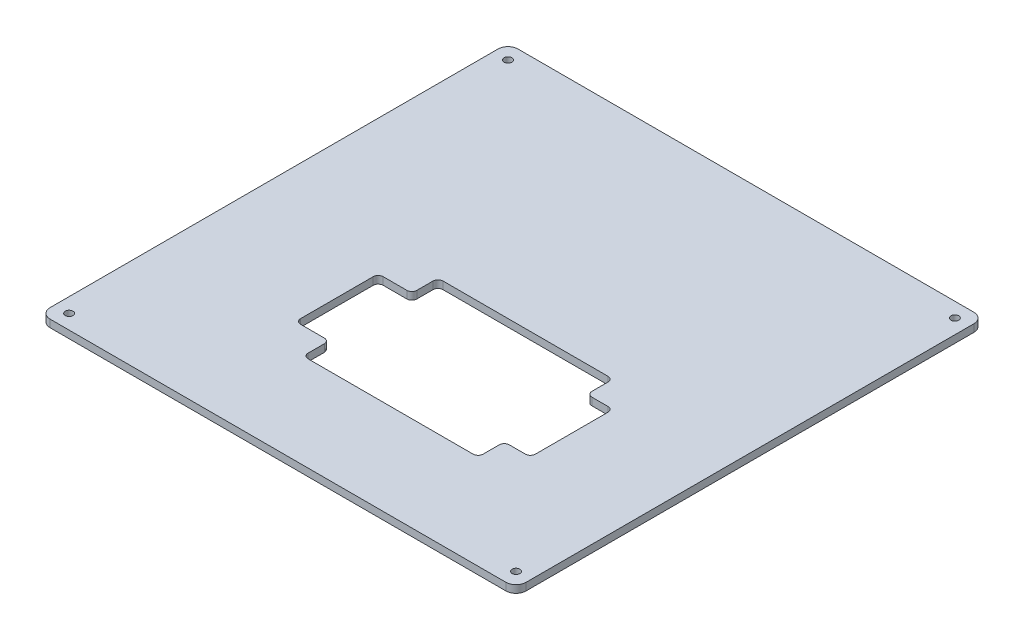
ISO-10303-21;
HEADER;
FILE_DESCRIPTION(('STEP AP214'),'2;1');
FILE_NAME('part.step','',(''),(''),'','','');
FILE_SCHEMA(('AUTOMOTIVE_DESIGN { 1 0 10303 214 1 1 1 1 }'));
ENDSEC;
DATA;
#1=APPLICATION_CONTEXT('core data for automotive mechanical design processes');
#2=APPLICATION_PROTOCOL_DEFINITION('international standard','automotive_design',2000,#1);
#3=PRODUCT_CONTEXT('',#1,'mechanical');
#4=PRODUCT('Part','Part','',(#3));
#5=PRODUCT_RELATED_PRODUCT_CATEGORY('part','',(#4));
#6=PRODUCT_DEFINITION_FORMATION('','',#4);
#7=PRODUCT_DEFINITION_CONTEXT('part definition',#1,'design');
#8=PRODUCT_DEFINITION('design','',#6,#7);
#9=PRODUCT_DEFINITION_SHAPE('','',#8);
#10=(LENGTH_UNIT() NAMED_UNIT(*) SI_UNIT(.MILLI.,.METRE.));
#11=(NAMED_UNIT(*) PLANE_ANGLE_UNIT() SI_UNIT($,.RADIAN.));
#12=(NAMED_UNIT(*) SI_UNIT($,.STERADIAN.) SOLID_ANGLE_UNIT());
#13=UNCERTAINTY_MEASURE_WITH_UNIT(LENGTH_MEASURE(1.E-05),#10,'distance_accuracy_value','');
#14=(GEOMETRIC_REPRESENTATION_CONTEXT(3) GLOBAL_UNCERTAINTY_ASSIGNED_CONTEXT((#13)) GLOBAL_UNIT_ASSIGNED_CONTEXT((#10,
#11,#12)) REPRESENTATION_CONTEXT('',''));
#15=CARTESIAN_POINT('',(0.,0.,0.));
#16=DIRECTION('',(0.,0.,1.));
#17=DIRECTION('',(1.,0.,0.));
#18=AXIS2_PLACEMENT_3D('',#15,#16,#17);
#19=CARTESIAN_POINT('',(-92.54,3.,93.49));
#20=DIRECTION('',(1.,0.,0.));
#21=DIRECTION('',(0.,0.,-1.));
#22=AXIS2_PLACEMENT_3D('',#19,#20,#21);
#23=PLANE('',#22);
#24=DIRECTION('',(0.,0.,1.));
#25=VECTOR('',#24,1.);
#26=CARTESIAN_POINT('',(-92.54,0.,93.49));
#27=LINE('',#26,#25);
#28=CARTESIAN_POINT('',(-92.54,0.,-89.4899999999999));
#29=VERTEX_POINT('',#28);
#30=CARTESIAN_POINT('',(-92.54,0.,89.49));
#31=VERTEX_POINT('',#30);
#32=EDGE_CURVE('E269',#29,#31,#27,.T.);
#33=ORIENTED_EDGE('',*,*,#32,.T.);
#34=DIRECTION('',(0.,-1.,0.));
#35=VECTOR('',#34,1.);
#36=CARTESIAN_POINT('',(-92.54,3.,89.49));
#37=LINE('',#36,#35);
#38=CARTESIAN_POINT('',(-92.54,3.,89.49));
#39=VERTEX_POINT('',#38);
#40=EDGE_CURVE('E247',#31,#39,#37,.F.);
#41=ORIENTED_EDGE('',*,*,#40,.T.);
#42=DIRECTION('',(0.,0.,1.));
#43=VECTOR('',#42,1.);
#44=CARTESIAN_POINT('',(-92.54,3.,93.49));
#45=LINE('',#44,#43);
#46=CARTESIAN_POINT('',(-92.54,3.,-89.4899999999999));
#47=VERTEX_POINT('',#46);
#48=EDGE_CURVE('E280',#47,#39,#45,.T.);
#49=ORIENTED_EDGE('',*,*,#48,.F.);
#50=DIRECTION('',(0.,-1.,0.));
#51=VECTOR('',#50,1.);
#52=CARTESIAN_POINT('',(-92.54,3.,-89.49));
#53=LINE('',#52,#51);
#54=EDGE_CURVE('E252',#47,#29,#53,.T.);
#55=ORIENTED_EDGE('',*,*,#54,.T.);
#56=EDGE_LOOP('',(#33,#41,#49,#55));
#57=FACE_BOUND('',#56,.T.);
#58=ADVANCED_FACE('F32',(#57),#23,.F.);
#59=CARTESIAN_POINT('',(-92.54,3.,93.49));
#60=DIRECTION('',(0.,0.,-1.));
#61=DIRECTION('',(-1.,0.,0.));
#62=AXIS2_PLACEMENT_3D('',#59,#60,#61);
#63=PLANE('',#62);
#64=DIRECTION('',(1.,0.,0.));
#65=VECTOR('',#64,1.);
#66=CARTESIAN_POINT('',(-92.54,3.,93.49));
#67=LINE('',#66,#65);
#68=CARTESIAN_POINT('',(-88.54,3.,93.49));
#69=VERTEX_POINT('',#68);
#70=CARTESIAN_POINT('',(93.64,3.,93.49));
#71=VERTEX_POINT('',#70);
#72=EDGE_CURVE('E262',#69,#71,#67,.T.);
#73=ORIENTED_EDGE('',*,*,#72,.F.);
#74=DIRECTION('',(0.,-1.,0.));
#75=VECTOR('',#74,1.);
#76=CARTESIAN_POINT('',(-88.54,3.,93.49));
#77=LINE('',#76,#75);
#78=CARTESIAN_POINT('',(-88.54,0.,93.49));
#79=VERTEX_POINT('',#78);
#80=EDGE_CURVE('E246',#69,#79,#77,.T.);
#81=ORIENTED_EDGE('',*,*,#80,.T.);
#82=DIRECTION('',(1.,0.,0.));
#83=VECTOR('',#82,1.);
#84=CARTESIAN_POINT('',(-92.54,0.,93.49));
#85=LINE('',#84,#83);
#86=CARTESIAN_POINT('',(93.64,0.,93.49));
#87=VERTEX_POINT('',#86);
#88=EDGE_CURVE('E259',#79,#87,#85,.T.);
#89=ORIENTED_EDGE('',*,*,#88,.T.);
#90=DIRECTION('',(0.,-1.,0.));
#91=VECTOR('',#90,1.);
#92=CARTESIAN_POINT('',(93.64,3.,93.49));
#93=LINE('',#92,#91);
#94=EDGE_CURVE('E264',#87,#71,#93,.F.);
#95=ORIENTED_EDGE('',*,*,#94,.T.);
#96=EDGE_LOOP('',(#73,#81,#89,#95));
#97=FACE_BOUND('',#96,.T.);
#98=ADVANCED_FACE('F258',(#97),#63,.F.);
#99=CARTESIAN_POINT('',(97.64,3.,93.49));
#100=DIRECTION('',(-1.,0.,0.));
#101=DIRECTION('',(0.,0.,1.));
#102=AXIS2_PLACEMENT_3D('',#99,#100,#101);
#103=PLANE('',#102);
#104=DIRECTION('',(0.,0.,-1.));
#105=VECTOR('',#104,1.);
#106=CARTESIAN_POINT('',(97.64,3.,93.49));
#107=LINE('',#106,#105);
#108=CARTESIAN_POINT('',(97.64,3.,89.49));
#109=VERTEX_POINT('',#108);
#110=CARTESIAN_POINT('',(97.64,3.,-89.4899999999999));
#111=VERTEX_POINT('',#110);
#112=EDGE_CURVE('E448',#109,#111,#107,.T.);
#113=ORIENTED_EDGE('',*,*,#112,.F.);
#114=DIRECTION('',(0.,-1.,0.));
#115=VECTOR('',#114,1.);
#116=CARTESIAN_POINT('',(97.64,3.,89.49));
#117=LINE('',#116,#115);
#118=CARTESIAN_POINT('',(97.64,0.,89.49));
#119=VERTEX_POINT('',#118);
#120=EDGE_CURVE('E300',#109,#119,#117,.T.);
#121=ORIENTED_EDGE('',*,*,#120,.T.);
#122=DIRECTION('',(0.,0.,-1.));
#123=VECTOR('',#122,1.);
#124=CARTESIAN_POINT('',(97.64,0.,93.49));
#125=LINE('',#124,#123);
#126=CARTESIAN_POINT('',(97.64,0.,-89.4899999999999));
#127=VERTEX_POINT('',#126);
#128=EDGE_CURVE('E268',#119,#127,#125,.T.);
#129=ORIENTED_EDGE('',*,*,#128,.T.);
#130=DIRECTION('',(0.,-1.,0.));
#131=VECTOR('',#130,1.);
#132=CARTESIAN_POINT('',(97.64,3.,-89.49));
#133=LINE('',#132,#131);
#134=EDGE_CURVE('E298',#127,#111,#133,.F.);
#135=ORIENTED_EDGE('',*,*,#134,.T.);
#136=EDGE_LOOP('',(#113,#121,#129,#135));
#137=FACE_BOUND('',#136,.T.);
#138=ADVANCED_FACE('F469',(#137),#103,.F.);
#139=CARTESIAN_POINT('',(-92.54,3.,-93.49));
#140=DIRECTION('',(0.,0.,1.));
#141=DIRECTION('',(1.,0.,0.));
#142=AXIS2_PLACEMENT_3D('',#139,#140,#141);
#143=PLANE('',#142);
#144=DIRECTION('',(-1.,0.,0.));
#145=VECTOR('',#144,1.);
#146=CARTESIAN_POINT('',(-92.54,3.,-93.49));
#147=LINE('',#146,#145);
#148=CARTESIAN_POINT('',(93.64,3.,-93.49));
#149=VERTEX_POINT('',#148);
#150=CARTESIAN_POINT('',(-88.54,3.,-93.49));
#151=VERTEX_POINT('',#150);
#152=EDGE_CURVE('E281',#149,#151,#147,.T.);
#153=ORIENTED_EDGE('',*,*,#152,.F.);
#154=DIRECTION('',(0.,-1.,0.));
#155=VECTOR('',#154,1.);
#156=CARTESIAN_POINT('',(93.64,3.,-93.49));
#157=LINE('',#156,#155);
#158=CARTESIAN_POINT('',(93.64,0.,-93.49));
#159=VERTEX_POINT('',#158);
#160=EDGE_CURVE('E305',#149,#159,#157,.T.);
#161=ORIENTED_EDGE('',*,*,#160,.T.);
#162=DIRECTION('',(-1.,0.,0.));
#163=VECTOR('',#162,1.);
#164=CARTESIAN_POINT('',(-92.54,0.,-93.49));
#165=LINE('',#164,#163);
#166=CARTESIAN_POINT('',(-88.54,0.,-93.49));
#167=VERTEX_POINT('',#166);
#168=EDGE_CURVE('E272',#159,#167,#165,.T.);
#169=ORIENTED_EDGE('',*,*,#168,.T.);
#170=DIRECTION('',(0.,-1.,0.));
#171=VECTOR('',#170,1.);
#172=CARTESIAN_POINT('',(-88.54,3.,-93.49));
#173=LINE('',#172,#171);
#174=EDGE_CURVE('E303',#167,#151,#173,.F.);
#175=ORIENTED_EDGE('',*,*,#174,.T.);
#176=EDGE_LOOP('',(#153,#161,#169,#175));
#177=FACE_BOUND('',#176,.T.);
#178=ADVANCED_FACE('F463',(#177),#143,.F.);
#179=CARTESIAN_POINT('',(0.,3.,0.));
#180=DIRECTION('',(0.,-1.,0.));
#181=DIRECTION('',(0.,0.,-1.));
#182=AXIS2_PLACEMENT_3D('',#179,#180,#181);
#183=PLANE('',#182);
#184=CARTESIAN_POINT('',(91.8399999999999,3.,87.69));
#185=DIRECTION('',(0.,-1.,0.));
#186=DIRECTION('',(0.,0.,-1.));
#187=AXIS2_PLACEMENT_3D('',#184,#185,#186);
#188=CIRCLE('',#187,1.54999999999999);
#189=CARTESIAN_POINT('',(91.8399999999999,3.,86.14));
#190=VERTEX_POINT('',#189);
#191=EDGE_CURVE('E577',#190,#190,#188,.F.);
#192=ORIENTED_EDGE('',*,*,#191,.F.);
#193=EDGE_LOOP('',(#192));
#194=FACE_BOUND('',#193,.T.);
#195=CARTESIAN_POINT('',(-86.7399999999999,3.,-87.69));
#196=DIRECTION('',(0.,-1.,0.));
#197=DIRECTION('',(0.,0.,-1.));
#198=AXIS2_PLACEMENT_3D('',#195,#196,#197);
#199=CIRCLE('',#198,1.54999999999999);
#200=CARTESIAN_POINT('',(-86.7399999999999,3.,-89.24));
#201=VERTEX_POINT('',#200);
#202=EDGE_CURVE('E570',#201,#201,#199,.F.);
#203=ORIENTED_EDGE('',*,*,#202,.F.);
#204=EDGE_LOOP('',(#203));
#205=FACE_BOUND('',#204,.T.);
#206=CARTESIAN_POINT('',(91.84,3.,-87.69));
#207=DIRECTION('',(0.,-1.,0.));
#208=DIRECTION('',(0.,0.,-1.));
#209=AXIS2_PLACEMENT_3D('',#206,#207,#208);
#210=CIRCLE('',#209,1.54999999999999);
#211=CARTESIAN_POINT('',(91.84,3.,-89.24));
#212=VERTEX_POINT('',#211);
#213=EDGE_CURVE('E565',#212,#212,#210,.F.);
#214=ORIENTED_EDGE('',*,*,#213,.F.);
#215=EDGE_LOOP('',(#214));
#216=FACE_BOUND('',#215,.T.);
#217=CARTESIAN_POINT('',(-86.74,3.,87.69));
#218=DIRECTION('',(0.,-1.,0.));
#219=DIRECTION('',(0.,0.,-1.));
#220=AXIS2_PLACEMENT_3D('',#217,#218,#219);
#221=CIRCLE('',#220,1.54999999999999);
#222=CARTESIAN_POINT('',(-86.74,3.,86.14));
#223=VERTEX_POINT('',#222);
#224=EDGE_CURVE('E585',#223,#223,#221,.F.);
#225=ORIENTED_EDGE('',*,*,#224,.F.);
#226=EDGE_LOOP('',(#225));
#227=FACE_BOUND('',#226,.T.);
#228=DIRECTION('',(-1.,0.,0.));
#229=VECTOR('',#228,1.);
#230=CARTESIAN_POINT('',(-35.68,3.,12.24));
#231=LINE('',#230,#229);
#232=CARTESIAN_POINT('',(-27.23,3.,12.24));
#233=VERTEX_POINT('',#232);
#234=CARTESIAN_POINT('',(-36.68,3.,12.24));
#235=VERTEX_POINT('',#234);
#236=EDGE_CURVE('E615',#233,#235,#231,.T.);
#237=ORIENTED_EDGE('',*,*,#236,.F.);
#238=CARTESIAN_POINT('',(-27.23,3.,10.24));
#239=DIRECTION('',(0.,-1.,0.));
#240=DIRECTION('',(0.,0.,-1.));
#241=AXIS2_PLACEMENT_3D('',#238,#239,#240);
#242=CIRCLE('',#241,2.);
#243=CARTESIAN_POINT('',(-25.23,3.,10.24));
#244=VERTEX_POINT('',#243);
#245=EDGE_CURVE('E336',#233,#244,#242,.F.);
#246=ORIENTED_EDGE('',*,*,#245,.T.);
#247=DIRECTION('',(0.,0.,1.));
#248=VECTOR('',#247,1.);
#249=CARTESIAN_POINT('',(-25.23,3.,1.79));
#250=LINE('',#249,#248);
#251=CARTESIAN_POINT('',(-25.23,3.,3.79));
#252=VERTEX_POINT('',#251);
#253=EDGE_CURVE('E612',#252,#244,#250,.T.);
#254=ORIENTED_EDGE('',*,*,#253,.F.);
#255=CARTESIAN_POINT('',(-23.23,3.,3.79));
#256=DIRECTION('',(0.,-1.,0.));
#257=DIRECTION('',(0.,0.,-1.));
#258=AXIS2_PLACEMENT_3D('',#255,#256,#257);
#259=CIRCLE('',#258,2.);
#260=CARTESIAN_POINT('',(-23.23,3.,1.79));
#261=VERTEX_POINT('',#260);
#262=EDGE_CURVE('E384',#252,#261,#259,.T.);
#263=ORIENTED_EDGE('',*,*,#262,.T.);
#264=DIRECTION('',(-1.,0.,0.));
#265=VECTOR('',#264,1.);
#266=CARTESIAN_POINT('',(55.15,3.,1.79000000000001));
#267=LINE('',#266,#265);
#268=CARTESIAN_POINT('',(42.7,3.,1.79000000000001));
#269=VERTEX_POINT('',#268);
#270=EDGE_CURVE('E629',#269,#261,#267,.T.);
#271=ORIENTED_EDGE('',*,*,#270,.F.);
#272=CARTESIAN_POINT('',(42.7,3.,3.79000000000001));
#273=DIRECTION('',(0.,-1.,0.));
#274=DIRECTION('',(0.,0.,-1.));
#275=AXIS2_PLACEMENT_3D('',#272,#273,#274);
#276=CIRCLE('',#275,2.);
#277=CARTESIAN_POINT('',(44.7,3.,3.79000000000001));
#278=VERTEX_POINT('',#277);
#279=EDGE_CURVE('E400',#269,#278,#276,.T.);
#280=ORIENTED_EDGE('',*,*,#279,.T.);
#281=DIRECTION('',(0.,0.,-1.));
#282=VECTOR('',#281,1.);
#283=CARTESIAN_POINT('',(44.7,3.,1.78999999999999));
#284=LINE('',#283,#282);
#285=CARTESIAN_POINT('',(44.7,3.,10.24));
#286=VERTEX_POINT('',#285);
#287=EDGE_CURVE('E426',#286,#278,#284,.T.);
#288=ORIENTED_EDGE('',*,*,#287,.F.);
#289=CARTESIAN_POINT('',(46.7,3.,10.24));
#290=DIRECTION('',(0.,-1.,0.));
#291=DIRECTION('',(0.,0.,-1.));
#292=AXIS2_PLACEMENT_3D('',#289,#290,#291);
#293=CIRCLE('',#292,2.);
#294=CARTESIAN_POINT('',(46.7,3.,12.24));
#295=VERTEX_POINT('',#294);
#296=EDGE_CURVE('E333',#286,#295,#293,.F.);
#297=ORIENTED_EDGE('',*,*,#296,.T.);
#298=DIRECTION('',(-1.,0.,0.));
#299=VECTOR('',#298,1.);
#300=CARTESIAN_POINT('',(55.15,3.,12.24));
#301=LINE('',#300,#299);
#302=CARTESIAN_POINT('',(53.15,3.,12.24));
#303=VERTEX_POINT('',#302);
#304=EDGE_CURVE('E595',#303,#295,#301,.T.);
#305=ORIENTED_EDGE('',*,*,#304,.F.);
#306=CARTESIAN_POINT('',(53.15,3.,14.24));
#307=DIRECTION('',(0.,-1.,0.));
#308=DIRECTION('',(0.,0.,-1.));
#309=AXIS2_PLACEMENT_3D('',#306,#307,#308);
#310=CIRCLE('',#309,2.);
#311=CARTESIAN_POINT('',(55.15,3.,14.24));
#312=VERTEX_POINT('',#311);
#313=EDGE_CURVE('E404',#303,#312,#310,.T.);
#314=ORIENTED_EDGE('',*,*,#313,.T.);
#315=DIRECTION('',(0.,0.,-1.));
#316=VECTOR('',#315,1.);
#317=CARTESIAN_POINT('',(55.15,3.,1.79000000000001));
#318=LINE('',#317,#316);
#319=CARTESIAN_POINT('',(55.15,3.,43.24));
#320=VERTEX_POINT('',#319);
#321=EDGE_CURVE('E636',#320,#312,#318,.T.);
#322=ORIENTED_EDGE('',*,*,#321,.F.);
#323=CARTESIAN_POINT('',(53.15,3.,43.24));
#324=DIRECTION('',(0.,-1.,0.));
#325=DIRECTION('',(0.,0.,-1.));
#326=AXIS2_PLACEMENT_3D('',#323,#324,#325);
#327=CIRCLE('',#326,2.);
#328=CARTESIAN_POINT('',(53.15,3.,45.24));
#329=VERTEX_POINT('',#328);
#330=EDGE_CURVE('E408',#320,#329,#327,.T.);
#331=ORIENTED_EDGE('',*,*,#330,.T.);
#332=DIRECTION('',(1.,0.,0.));
#333=VECTOR('',#332,1.);
#334=CARTESIAN_POINT('',(55.15,3.,45.24));
#335=LINE('',#334,#333);
#336=CARTESIAN_POINT('',(46.7,3.,45.24));
#337=VERTEX_POINT('',#336);
#338=EDGE_CURVE('E606',#337,#329,#335,.T.);
#339=ORIENTED_EDGE('',*,*,#338,.F.);
#340=CARTESIAN_POINT('',(46.7,3.,47.24));
#341=DIRECTION('',(0.,-1.,0.));
#342=DIRECTION('',(0.,0.,-1.));
#343=AXIS2_PLACEMENT_3D('',#340,#341,#342);
#344=CIRCLE('',#343,2.);
#345=CARTESIAN_POINT('',(44.7,3.,47.24));
#346=VERTEX_POINT('',#345);
#347=EDGE_CURVE('E331',#337,#346,#344,.F.);
#348=ORIENTED_EDGE('',*,*,#347,.T.);
#349=DIRECTION('',(0.,0.,-1.));
#350=VECTOR('',#349,1.);
#351=CARTESIAN_POINT('',(44.7,3.,55.69));
#352=LINE('',#351,#350);
#353=CARTESIAN_POINT('',(44.7,3.,53.69));
#354=VERTEX_POINT('',#353);
#355=EDGE_CURVE('E435',#354,#346,#352,.T.);
#356=ORIENTED_EDGE('',*,*,#355,.F.);
#357=CARTESIAN_POINT('',(42.7,3.,53.69));
#358=DIRECTION('',(0.,-1.,0.));
#359=DIRECTION('',(0.,0.,-1.));
#360=AXIS2_PLACEMENT_3D('',#357,#358,#359);
#361=CIRCLE('',#360,2.);
#362=CARTESIAN_POINT('',(42.7,3.,55.69));
#363=VERTEX_POINT('',#362);
#364=EDGE_CURVE('E11',#354,#363,#361,.T.);
#365=ORIENTED_EDGE('',*,*,#364,.T.);
#366=DIRECTION('',(1.,0.,0.));
#367=VECTOR('',#366,1.);
#368=CARTESIAN_POINT('',(55.15,3.,55.69));
#369=LINE('',#368,#367);
#370=CARTESIAN_POINT('',(-23.23,3.,55.69));
#371=VERTEX_POINT('',#370);
#372=EDGE_CURVE('E274',#371,#363,#369,.T.);
#373=ORIENTED_EDGE('',*,*,#372,.F.);
#374=CARTESIAN_POINT('',(-23.23,3.,53.69));
#375=DIRECTION('',(0.,-1.,0.));
#376=DIRECTION('',(0.,0.,-1.));
#377=AXIS2_PLACEMENT_3D('',#374,#375,#376);
#378=CIRCLE('',#377,2.);
#379=CARTESIAN_POINT('',(-25.23,3.,53.69));
#380=VERTEX_POINT('',#379);
#381=EDGE_CURVE('E396',#371,#380,#378,.T.);
#382=ORIENTED_EDGE('',*,*,#381,.T.);
#383=DIRECTION('',(0.,0.,1.));
#384=VECTOR('',#383,1.);
#385=CARTESIAN_POINT('',(-25.23,3.,55.69));
#386=LINE('',#385,#384);
#387=CARTESIAN_POINT('',(-25.23,3.,47.24));
#388=VERTEX_POINT('',#387);
#389=EDGE_CURVE('E625',#388,#380,#386,.T.);
#390=ORIENTED_EDGE('',*,*,#389,.F.);
#391=CARTESIAN_POINT('',(-27.23,3.,47.24));
#392=DIRECTION('',(0.,-1.,0.));
#393=DIRECTION('',(0.,0.,-1.));
#394=AXIS2_PLACEMENT_3D('',#391,#392,#393);
#395=CIRCLE('',#394,2.);
#396=CARTESIAN_POINT('',(-27.23,3.,45.24));
#397=VERTEX_POINT('',#396);
#398=EDGE_CURVE('E47',#388,#397,#395,.F.);
#399=ORIENTED_EDGE('',*,*,#398,.T.);
#400=DIRECTION('',(1.,0.,0.));
#401=VECTOR('',#400,1.);
#402=CARTESIAN_POINT('',(-35.68,3.,45.24));
#403=LINE('',#402,#401);
#404=CARTESIAN_POINT('',(-36.68,3.,45.24));
#405=VERTEX_POINT('',#404);
#406=EDGE_CURVE('E623',#405,#397,#403,.T.);
#407=ORIENTED_EDGE('',*,*,#406,.F.);
#408=CARTESIAN_POINT('',(-36.68,3.,43.24));
#409=DIRECTION('',(0.,-1.,0.));
#410=DIRECTION('',(0.,0.,-1.));
#411=AXIS2_PLACEMENT_3D('',#408,#409,#410);
#412=CIRCLE('',#411,2.);
#413=CARTESIAN_POINT('',(-38.68,3.,43.24));
#414=VERTEX_POINT('',#413);
#415=EDGE_CURVE('E392',#405,#414,#412,.T.);
#416=ORIENTED_EDGE('',*,*,#415,.T.);
#417=DIRECTION('',(0.,0.,1.));
#418=VECTOR('',#417,1.);
#419=CARTESIAN_POINT('',(-38.68,3.,12.24));
#420=LINE('',#419,#418);
#421=CARTESIAN_POINT('',(-38.68,3.,14.24));
#422=VERTEX_POINT('',#421);
#423=EDGE_CURVE('E588',#422,#414,#420,.T.);
#424=ORIENTED_EDGE('',*,*,#423,.F.);
#425=CARTESIAN_POINT('',(-36.68,3.,14.24));
#426=DIRECTION('',(0.,-1.,0.));
#427=DIRECTION('',(0.,0.,-1.));
#428=AXIS2_PLACEMENT_3D('',#425,#426,#427);
#429=CIRCLE('',#428,2.);
#430=EDGE_CURVE('E388',#422,#235,#429,.T.);
#431=ORIENTED_EDGE('',*,*,#430,.T.);
#432=EDGE_LOOP('',(#237,#246,#254,#263,#271,#280,#288,#297,#305,#314,#322,#331,#339,#348,#356,
#365,#373,#382,#390,#399,#407,#416,#424,#431));
#433=FACE_BOUND('',#432,.T.);
#434=ORIENTED_EDGE('',*,*,#48,.T.);
#435=CARTESIAN_POINT('',(-88.54,3.,89.49));
#436=DIRECTION('',(0.,-1.,0.));
#437=DIRECTION('',(0.,0.,-1.));
#438=AXIS2_PLACEMENT_3D('',#435,#436,#437);
#439=CIRCLE('',#438,4.);
#440=EDGE_CURVE('E296',#39,#69,#439,.F.);
#441=ORIENTED_EDGE('',*,*,#440,.T.);
#442=ORIENTED_EDGE('',*,*,#72,.T.);
#443=CARTESIAN_POINT('',(93.64,3.,89.49));
#444=DIRECTION('',(0.,-1.,0.));
#445=DIRECTION('',(0.,0.,-1.));
#446=AXIS2_PLACEMENT_3D('',#443,#444,#445);
#447=CIRCLE('',#446,4.);
#448=EDGE_CURVE('E294',#71,#109,#447,.F.);
#449=ORIENTED_EDGE('',*,*,#448,.T.);
#450=ORIENTED_EDGE('',*,*,#112,.T.);
#451=CARTESIAN_POINT('',(93.64,3.,-89.49));
#452=DIRECTION('',(0.,-1.,0.));
#453=DIRECTION('',(0.,0.,-1.));
#454=AXIS2_PLACEMENT_3D('',#451,#452,#453);
#455=CIRCLE('',#454,4.);
#456=EDGE_CURVE('E292',#111,#149,#455,.F.);
#457=ORIENTED_EDGE('',*,*,#456,.T.);
#458=ORIENTED_EDGE('',*,*,#152,.T.);
#459=CARTESIAN_POINT('',(-88.54,3.,-89.49));
#460=DIRECTION('',(0.,-1.,0.));
#461=DIRECTION('',(0.,0.,-1.));
#462=AXIS2_PLACEMENT_3D('',#459,#460,#461);
#463=CIRCLE('',#462,4.);
#464=EDGE_CURVE('E290',#151,#47,#463,.F.);
#465=ORIENTED_EDGE('',*,*,#464,.T.);
#466=EDGE_LOOP('',(#434,#441,#442,#449,#450,#457,#458,#465));
#467=FACE_BOUND('',#466,.T.);
#468=ADVANCED_FACE('F432',(#194,#205,#216,#227,#433,#467),#183,.F.);
#469=CARTESIAN_POINT('',(0.,0.,0.));
#470=DIRECTION('',(0.,-1.,0.));
#471=DIRECTION('',(0.,0.,-1.));
#472=AXIS2_PLACEMENT_3D('',#469,#470,#471);
#473=PLANE('',#472);
#474=CARTESIAN_POINT('',(91.8399999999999,0.,87.69));
#475=DIRECTION('',(0.,-1.,0.));
#476=DIRECTION('',(0.,0.,1.));
#477=AXIS2_PLACEMENT_3D('',#474,#475,#476);
#478=CIRCLE('',#477,1.54999999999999);
#479=CARTESIAN_POINT('',(91.8399999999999,0.,86.14));
#480=VERTEX_POINT('',#479);
#481=EDGE_CURVE('E574',#480,#480,#478,.T.);
#482=ORIENTED_EDGE('',*,*,#481,.F.);
#483=EDGE_LOOP('',(#482));
#484=FACE_BOUND('',#483,.T.);
#485=CARTESIAN_POINT('',(-86.7399999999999,0.,-87.69));
#486=DIRECTION('',(0.,-1.,0.));
#487=DIRECTION('',(0.,0.,1.));
#488=AXIS2_PLACEMENT_3D('',#485,#486,#487);
#489=CIRCLE('',#488,1.54999999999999);
#490=CARTESIAN_POINT('',(-86.7399999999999,0.,-89.24));
#491=VERTEX_POINT('',#490);
#492=EDGE_CURVE('E567',#491,#491,#489,.T.);
#493=ORIENTED_EDGE('',*,*,#492,.F.);
#494=EDGE_LOOP('',(#493));
#495=FACE_BOUND('',#494,.T.);
#496=CARTESIAN_POINT('',(91.84,0.,-87.69));
#497=DIRECTION('',(0.,-1.,0.));
#498=DIRECTION('',(0.,0.,-1.));
#499=AXIS2_PLACEMENT_3D('',#496,#497,#498);
#500=CIRCLE('',#499,1.54999999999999);
#501=CARTESIAN_POINT('',(91.84,0.,-89.24));
#502=VERTEX_POINT('',#501);
#503=EDGE_CURVE('E562',#502,#502,#500,.T.);
#504=ORIENTED_EDGE('',*,*,#503,.F.);
#505=EDGE_LOOP('',(#504));
#506=FACE_BOUND('',#505,.T.);
#507=CARTESIAN_POINT('',(-86.74,0.,87.69));
#508=DIRECTION('',(0.,-1.,0.));
#509=DIRECTION('',(0.,0.,-1.));
#510=AXIS2_PLACEMENT_3D('',#507,#508,#509);
#511=CIRCLE('',#510,1.54999999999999);
#512=CARTESIAN_POINT('',(-86.74,0.,86.14));
#513=VERTEX_POINT('',#512);
#514=EDGE_CURVE('E579',#513,#513,#511,.T.);
#515=ORIENTED_EDGE('',*,*,#514,.F.);
#516=EDGE_LOOP('',(#515));
#517=FACE_BOUND('',#516,.T.);
#518=DIRECTION('',(0.,0.,1.));
#519=VECTOR('',#518,1.);
#520=CARTESIAN_POINT('',(-25.23,0.,1.79));
#521=LINE('',#520,#519);
#522=CARTESIAN_POINT('',(-25.23,0.,3.79));
#523=VERTEX_POINT('',#522);
#524=CARTESIAN_POINT('',(-25.23,0.,10.24));
#525=VERTEX_POINT('',#524);
#526=EDGE_CURVE('E608',#523,#525,#521,.T.);
#527=ORIENTED_EDGE('',*,*,#526,.T.);
#528=CARTESIAN_POINT('',(-27.23,0.,10.24));
#529=DIRECTION('',(0.,-1.,0.));
#530=DIRECTION('',(0.,0.,-1.));
#531=AXIS2_PLACEMENT_3D('',#528,#529,#530);
#532=CIRCLE('',#531,2.);
#533=CARTESIAN_POINT('',(-27.23,0.,12.24));
#534=VERTEX_POINT('',#533);
#535=EDGE_CURVE('E324',#525,#534,#532,.T.);
#536=ORIENTED_EDGE('',*,*,#535,.T.);
#537=DIRECTION('',(-1.,0.,0.));
#538=VECTOR('',#537,1.);
#539=CARTESIAN_POINT('',(-35.68,0.,12.24));
#540=LINE('',#539,#538);
#541=CARTESIAN_POINT('',(-36.68,0.,12.24));
#542=VERTEX_POINT('',#541);
#543=EDGE_CURVE('E616',#534,#542,#540,.T.);
#544=ORIENTED_EDGE('',*,*,#543,.T.);
#545=CARTESIAN_POINT('',(-36.68,0.,14.24));
#546=DIRECTION('',(0.,-1.,0.));
#547=DIRECTION('',(0.,0.,-1.));
#548=AXIS2_PLACEMENT_3D('',#545,#546,#547);
#549=CIRCLE('',#548,2.);
#550=CARTESIAN_POINT('',(-38.68,0.,14.24));
#551=VERTEX_POINT('',#550);
#552=EDGE_CURVE('E386',#542,#551,#549,.F.);
#553=ORIENTED_EDGE('',*,*,#552,.T.);
#554=DIRECTION('',(0.,0.,-1.));
#555=VECTOR('',#554,1.);
#556=CARTESIAN_POINT('',(-38.68,0.,12.24));
#557=LINE('',#556,#555);
#558=CARTESIAN_POINT('',(-38.68,0.,43.24));
#559=VERTEX_POINT('',#558);
#560=EDGE_CURVE('E591',#559,#551,#557,.T.);
#561=ORIENTED_EDGE('',*,*,#560,.F.);
#562=CARTESIAN_POINT('',(-36.68,0.,43.24));
#563=DIRECTION('',(0.,-1.,0.));
#564=DIRECTION('',(0.,0.,-1.));
#565=AXIS2_PLACEMENT_3D('',#562,#563,#564);
#566=CIRCLE('',#565,2.);
#567=CARTESIAN_POINT('',(-36.68,0.,45.24));
#568=VERTEX_POINT('',#567);
#569=EDGE_CURVE('E390',#559,#568,#566,.F.);
#570=ORIENTED_EDGE('',*,*,#569,.T.);
#571=DIRECTION('',(1.,0.,0.));
#572=VECTOR('',#571,1.);
#573=CARTESIAN_POINT('',(-35.68,0.,45.24));
#574=LINE('',#573,#572);
#575=CARTESIAN_POINT('',(-27.23,0.,45.24));
#576=VERTEX_POINT('',#575);
#577=EDGE_CURVE('E619',#568,#576,#574,.T.);
#578=ORIENTED_EDGE('',*,*,#577,.T.);
#579=CARTESIAN_POINT('',(-27.23,0.,47.24));
#580=DIRECTION('',(0.,-1.,0.));
#581=DIRECTION('',(0.,0.,-1.));
#582=AXIS2_PLACEMENT_3D('',#579,#580,#581);
#583=CIRCLE('',#582,2.);
#584=CARTESIAN_POINT('',(-25.23,0.,47.24));
#585=VERTEX_POINT('',#584);
#586=EDGE_CURVE('E322',#576,#585,#583,.T.);
#587=ORIENTED_EDGE('',*,*,#586,.T.);
#588=DIRECTION('',(0.,0.,1.));
#589=VECTOR('',#588,1.);
#590=CARTESIAN_POINT('',(-25.23,0.,55.69));
#591=LINE('',#590,#589);
#592=CARTESIAN_POINT('',(-25.23,0.,53.69));
#593=VERTEX_POINT('',#592);
#594=EDGE_CURVE('E626',#585,#593,#591,.T.);
#595=ORIENTED_EDGE('',*,*,#594,.T.);
#596=CARTESIAN_POINT('',(-23.23,0.,53.69));
#597=DIRECTION('',(0.,-1.,0.));
#598=DIRECTION('',(0.,0.,-1.));
#599=AXIS2_PLACEMENT_3D('',#596,#597,#598);
#600=CIRCLE('',#599,2.);
#601=CARTESIAN_POINT('',(-23.23,0.,55.69));
#602=VERTEX_POINT('',#601);
#603=EDGE_CURVE('E394',#593,#602,#600,.F.);
#604=ORIENTED_EDGE('',*,*,#603,.T.);
#605=DIRECTION('',(-1.,0.,0.));
#606=VECTOR('',#605,1.);
#607=CARTESIAN_POINT('',(55.15,0.,55.69));
#608=LINE('',#607,#606);
#609=CARTESIAN_POINT('',(42.7,0.,55.69));
#610=VERTEX_POINT('',#609);
#611=EDGE_CURVE('E416',#610,#602,#608,.T.);
#612=ORIENTED_EDGE('',*,*,#611,.F.);
#613=CARTESIAN_POINT('',(42.7,0.,53.69));
#614=DIRECTION('',(0.,-1.,0.));
#615=DIRECTION('',(0.,0.,-1.));
#616=AXIS2_PLACEMENT_3D('',#613,#614,#615);
#617=CIRCLE('',#616,2.);
#618=CARTESIAN_POINT('',(44.7,0.,53.69));
#619=VERTEX_POINT('',#618);
#620=EDGE_CURVE('E40',#610,#619,#617,.F.);
#621=ORIENTED_EDGE('',*,*,#620,.T.);
#622=DIRECTION('',(0.,0.,-1.));
#623=VECTOR('',#622,1.);
#624=CARTESIAN_POINT('',(44.7,0.,55.69));
#625=LINE('',#624,#623);
#626=CARTESIAN_POINT('',(44.7,0.,47.24));
#627=VERTEX_POINT('',#626);
#628=EDGE_CURVE('E414',#619,#627,#625,.T.);
#629=ORIENTED_EDGE('',*,*,#628,.T.);
#630=CARTESIAN_POINT('',(46.7,0.,47.24));
#631=DIRECTION('',(0.,-1.,0.));
#632=DIRECTION('',(0.,0.,-1.));
#633=AXIS2_PLACEMENT_3D('',#630,#631,#632);
#634=CIRCLE('',#633,2.);
#635=CARTESIAN_POINT('',(46.7,0.,45.24));
#636=VERTEX_POINT('',#635);
#637=EDGE_CURVE('E318',#627,#636,#634,.T.);
#638=ORIENTED_EDGE('',*,*,#637,.T.);
#639=DIRECTION('',(1.,0.,0.));
#640=VECTOR('',#639,1.);
#641=CARTESIAN_POINT('',(55.15,0.,45.24));
#642=LINE('',#641,#640);
#643=CARTESIAN_POINT('',(53.15,0.,45.24));
#644=VERTEX_POINT('',#643);
#645=EDGE_CURVE('E425',#636,#644,#642,.T.);
#646=ORIENTED_EDGE('',*,*,#645,.T.);
#647=CARTESIAN_POINT('',(53.15,0.,43.24));
#648=DIRECTION('',(0.,-1.,0.));
#649=DIRECTION('',(0.,0.,-1.));
#650=AXIS2_PLACEMENT_3D('',#647,#648,#649);
#651=CIRCLE('',#650,2.);
#652=CARTESIAN_POINT('',(55.15,0.,43.24));
#653=VERTEX_POINT('',#652);
#654=EDGE_CURVE('E406',#644,#653,#651,.F.);
#655=ORIENTED_EDGE('',*,*,#654,.T.);
#656=DIRECTION('',(0.,0.,1.));
#657=VECTOR('',#656,1.);
#658=CARTESIAN_POINT('',(55.15,0.,1.79000000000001));
#659=LINE('',#658,#657);
#660=CARTESIAN_POINT('',(55.15,0.,14.24));
#661=VERTEX_POINT('',#660);
#662=EDGE_CURVE('E639',#661,#653,#659,.T.);
#663=ORIENTED_EDGE('',*,*,#662,.F.);
#664=CARTESIAN_POINT('',(53.15,0.,14.24));
#665=DIRECTION('',(0.,-1.,0.));
#666=DIRECTION('',(0.,0.,-1.));
#667=AXIS2_PLACEMENT_3D('',#664,#665,#666);
#668=CIRCLE('',#667,2.);
#669=CARTESIAN_POINT('',(53.15,0.,12.24));
#670=VERTEX_POINT('',#669);
#671=EDGE_CURVE('E402',#661,#670,#668,.F.);
#672=ORIENTED_EDGE('',*,*,#671,.T.);
#673=DIRECTION('',(-1.,0.,0.));
#674=VECTOR('',#673,1.);
#675=CARTESIAN_POINT('',(55.15,0.,12.24));
#676=LINE('',#675,#674);
#677=CARTESIAN_POINT('',(46.7,0.,12.24));
#678=VERTEX_POINT('',#677);
#679=EDGE_CURVE('E594',#670,#678,#676,.T.);
#680=ORIENTED_EDGE('',*,*,#679,.T.);
#681=CARTESIAN_POINT('',(46.7,0.,10.24));
#682=DIRECTION('',(0.,-1.,0.));
#683=DIRECTION('',(0.,0.,-1.));
#684=AXIS2_PLACEMENT_3D('',#681,#682,#683);
#685=CIRCLE('',#684,2.);
#686=CARTESIAN_POINT('',(44.7,0.,10.24));
#687=VERTEX_POINT('',#686);
#688=EDGE_CURVE('E320',#678,#687,#685,.T.);
#689=ORIENTED_EDGE('',*,*,#688,.T.);
#690=DIRECTION('',(0.,0.,-1.));
#691=VECTOR('',#690,1.);
#692=CARTESIAN_POINT('',(44.7,0.,1.78999999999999));
#693=LINE('',#692,#691);
#694=CARTESIAN_POINT('',(44.7,0.,3.79000000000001));
#695=VERTEX_POINT('',#694);
#696=EDGE_CURVE('E598',#687,#695,#693,.T.);
#697=ORIENTED_EDGE('',*,*,#696,.T.);
#698=CARTESIAN_POINT('',(42.7,0.,3.79000000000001));
#699=DIRECTION('',(0.,-1.,0.));
#700=DIRECTION('',(0.,0.,-1.));
#701=AXIS2_PLACEMENT_3D('',#698,#699,#700);
#702=CIRCLE('',#701,2.);
#703=CARTESIAN_POINT('',(42.7,0.,1.79000000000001));
#704=VERTEX_POINT('',#703);
#705=EDGE_CURVE('E398',#695,#704,#702,.F.);
#706=ORIENTED_EDGE('',*,*,#705,.T.);
#707=DIRECTION('',(1.,0.,0.));
#708=VECTOR('',#707,1.);
#709=CARTESIAN_POINT('',(55.15,0.,1.79000000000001));
#710=LINE('',#709,#708);
#711=CARTESIAN_POINT('',(-23.23,0.,1.79));
#712=VERTEX_POINT('',#711);
#713=EDGE_CURVE('E439',#712,#704,#710,.T.);
#714=ORIENTED_EDGE('',*,*,#713,.F.);
#715=CARTESIAN_POINT('',(-23.23,0.,3.79));
#716=DIRECTION('',(0.,-1.,0.));
#717=DIRECTION('',(0.,0.,-1.));
#718=AXIS2_PLACEMENT_3D('',#715,#716,#717);
#719=CIRCLE('',#718,2.);
#720=EDGE_CURVE('E382',#712,#523,#719,.F.);
#721=ORIENTED_EDGE('',*,*,#720,.T.);
#722=EDGE_LOOP('',(#527,#536,#544,#553,#561,#570,#578,#587,#595,#604,#612,#621,#629,#638,#646,
#655,#663,#672,#680,#689,#697,#706,#714,#721));
#723=FACE_BOUND('',#722,.T.);
#724=ORIENTED_EDGE('',*,*,#88,.F.);
#725=CARTESIAN_POINT('',(-88.54,0.,89.49));
#726=DIRECTION('',(0.,-1.,0.));
#727=DIRECTION('',(0.,0.,-1.));
#728=AXIS2_PLACEMENT_3D('',#725,#726,#727);
#729=CIRCLE('',#728,4.);
#730=EDGE_CURVE('E242',#79,#31,#729,.T.);
#731=ORIENTED_EDGE('',*,*,#730,.T.);
#732=ORIENTED_EDGE('',*,*,#32,.F.);
#733=CARTESIAN_POINT('',(-88.54,0.,-89.49));
#734=DIRECTION('',(0.,-1.,0.));
#735=DIRECTION('',(0.,0.,-1.));
#736=AXIS2_PLACEMENT_3D('',#733,#734,#735);
#737=CIRCLE('',#736,4.);
#738=EDGE_CURVE('E263',#29,#167,#737,.T.);
#739=ORIENTED_EDGE('',*,*,#738,.T.);
#740=ORIENTED_EDGE('',*,*,#168,.F.);
#741=CARTESIAN_POINT('',(93.64,0.,-89.49));
#742=DIRECTION('',(0.,-1.,0.));
#743=DIRECTION('',(0.,0.,-1.));
#744=AXIS2_PLACEMENT_3D('',#741,#742,#743);
#745=CIRCLE('',#744,4.);
#746=EDGE_CURVE('E284',#159,#127,#745,.T.);
#747=ORIENTED_EDGE('',*,*,#746,.T.);
#748=ORIENTED_EDGE('',*,*,#128,.F.);
#749=CARTESIAN_POINT('',(93.64,0.,89.49));
#750=DIRECTION('',(0.,-1.,0.));
#751=DIRECTION('',(0.,0.,-1.));
#752=AXIS2_PLACEMENT_3D('',#749,#750,#751);
#753=CIRCLE('',#752,4.);
#754=EDGE_CURVE('E253',#119,#87,#753,.T.);
#755=ORIENTED_EDGE('',*,*,#754,.T.);
#756=EDGE_LOOP('',(#724,#731,#732,#739,#740,#747,#748,#755));
#757=FACE_BOUND('',#756,.T.);
#758=ADVANCED_FACE('F266',(#484,#495,#506,#517,#723,#757),#473,.T.);
#759=CARTESIAN_POINT('',(55.15,3.001,1.79000000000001));
#760=DIRECTION('',(1.,0.,0.));
#761=DIRECTION('',(0.,0.,-1.));
#762=AXIS2_PLACEMENT_3D('',#759,#760,#761);
#763=PLANE('',#762);
#764=ORIENTED_EDGE('',*,*,#321,.T.);
#765=DIRECTION('',(0.,-1.,0.));
#766=VECTOR('',#765,1.);
#767=CARTESIAN_POINT('',(55.15,3.001,14.24));
#768=LINE('',#767,#766);
#769=EDGE_CURVE('E369',#312,#661,#768,.T.);
#770=ORIENTED_EDGE('',*,*,#769,.T.);
#771=ORIENTED_EDGE('',*,*,#662,.T.);
#772=DIRECTION('',(0.,-1.,0.));
#773=VECTOR('',#772,1.);
#774=CARTESIAN_POINT('',(55.15,3.001,43.24));
#775=LINE('',#774,#773);
#776=EDGE_CURVE('E367',#653,#320,#775,.F.);
#777=ORIENTED_EDGE('',*,*,#776,.T.);
#778=EDGE_LOOP('',(#764,#770,#771,#777));
#779=FACE_BOUND('',#778,.T.);
#780=ADVANCED_FACE('F496',(#779),#763,.F.);
#781=CARTESIAN_POINT('',(55.15,3.001,1.79000000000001));
#782=DIRECTION('',(0.,0.,-1.));
#783=DIRECTION('',(-1.,0.,0.));
#784=AXIS2_PLACEMENT_3D('',#781,#782,#783);
#785=PLANE('',#784);
#786=ORIENTED_EDGE('',*,*,#270,.T.);
#787=DIRECTION('',(0.,-1.,0.));
#788=VECTOR('',#787,1.);
#789=CARTESIAN_POINT('',(-23.23,3.001,1.79));
#790=LINE('',#789,#788);
#791=EDGE_CURVE('E310',#261,#712,#790,.T.);
#792=ORIENTED_EDGE('',*,*,#791,.T.);
#793=ORIENTED_EDGE('',*,*,#713,.T.);
#794=DIRECTION('',(0.,-1.,0.));
#795=VECTOR('',#794,1.);
#796=CARTESIAN_POINT('',(42.7,3.001,1.79000000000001));
#797=LINE('',#796,#795);
#798=EDGE_CURVE('E308',#704,#269,#797,.F.);
#799=ORIENTED_EDGE('',*,*,#798,.T.);
#800=EDGE_LOOP('',(#786,#792,#793,#799));
#801=FACE_BOUND('',#800,.T.);
#802=ADVANCED_FACE('F503',(#801),#785,.F.);
#803=CARTESIAN_POINT('',(55.15,3.001,55.69));
#804=DIRECTION('',(0.,0.,1.));
#805=DIRECTION('',(1.,0.,0.));
#806=AXIS2_PLACEMENT_3D('',#803,#804,#805);
#807=PLANE('',#806);
#808=ORIENTED_EDGE('',*,*,#611,.T.);
#809=DIRECTION('',(0.,-1.,0.));
#810=VECTOR('',#809,1.);
#811=CARTESIAN_POINT('',(-23.23,3.001,55.69));
#812=LINE('',#811,#810);
#813=EDGE_CURVE('E355',#602,#371,#812,.F.);
#814=ORIENTED_EDGE('',*,*,#813,.T.);
#815=ORIENTED_EDGE('',*,*,#372,.T.);
#816=DIRECTION('',(0.,-1.,0.));
#817=VECTOR('',#816,1.);
#818=CARTESIAN_POINT('',(42.7,3.001,55.69));
#819=LINE('',#818,#817);
#820=EDGE_CURVE('E352',#363,#610,#819,.T.);
#821=ORIENTED_EDGE('',*,*,#820,.T.);
#822=EDGE_LOOP('',(#808,#814,#815,#821));
#823=FACE_BOUND('',#822,.T.);
#824=ADVANCED_FACE('F437',(#823),#807,.F.);
#825=CARTESIAN_POINT('',(-25.23,3.,55.69));
#826=DIRECTION('',(1.,0.,0.));
#827=DIRECTION('',(0.,0.,-1.));
#828=AXIS2_PLACEMENT_3D('',#825,#826,#827);
#829=PLANE('',#828);
#830=ORIENTED_EDGE('',*,*,#594,.F.);
#831=DIRECTION('',(0.,-1.,0.));
#832=VECTOR('',#831,1.);
#833=CARTESIAN_POINT('',(-25.23,3.,47.24));
#834=LINE('',#833,#832);
#835=EDGE_CURVE('E350',#585,#388,#834,.F.);
#836=ORIENTED_EDGE('',*,*,#835,.T.);
#837=ORIENTED_EDGE('',*,*,#389,.T.);
#838=DIRECTION('',(0.,-1.,0.));
#839=VECTOR('',#838,1.);
#840=CARTESIAN_POINT('',(-25.23,3.,53.69));
#841=LINE('',#840,#839);
#842=EDGE_CURVE('E347',#380,#593,#841,.T.);
#843=ORIENTED_EDGE('',*,*,#842,.T.);
#844=EDGE_LOOP('',(#830,#836,#837,#843));
#845=FACE_BOUND('',#844,.T.);
#846=ADVANCED_FACE('F507',(#845),#829,.T.);
#847=CARTESIAN_POINT('',(-35.68,3.,45.24));
#848=DIRECTION('',(0.,0.,-1.));
#849=DIRECTION('',(-1.,0.,0.));
#850=AXIS2_PLACEMENT_3D('',#847,#848,#849);
#851=PLANE('',#850);
#852=ORIENTED_EDGE('',*,*,#577,.F.);
#853=DIRECTION('',(0.,-1.,0.));
#854=VECTOR('',#853,1.);
#855=CARTESIAN_POINT('',(-36.68,3.,45.24));
#856=LINE('',#855,#854);
#857=EDGE_CURVE('E54',#568,#405,#856,.F.);
#858=ORIENTED_EDGE('',*,*,#857,.T.);
#859=ORIENTED_EDGE('',*,*,#406,.T.);
#860=DIRECTION('',(0.,-1.,0.));
#861=VECTOR('',#860,1.);
#862=CARTESIAN_POINT('',(-27.23,3.,45.24));
#863=LINE('',#862,#861);
#864=EDGE_CURVE('E343',#397,#576,#863,.T.);
#865=ORIENTED_EDGE('',*,*,#864,.T.);
#866=EDGE_LOOP('',(#852,#858,#859,#865));
#867=FACE_BOUND('',#866,.T.);
#868=ADVANCED_FACE('F511',(#867),#851,.T.);
#869=CARTESIAN_POINT('',(-35.68,3.,12.24));
#870=DIRECTION('',(0.,0.,1.));
#871=DIRECTION('',(1.,0.,0.));
#872=AXIS2_PLACEMENT_3D('',#869,#870,#871);
#873=PLANE('',#872);
#874=ORIENTED_EDGE('',*,*,#543,.F.);
#875=DIRECTION('',(0.,-1.,0.));
#876=VECTOR('',#875,1.);
#877=CARTESIAN_POINT('',(-27.23,3.,12.24));
#878=LINE('',#877,#876);
#879=EDGE_CURVE('E329',#534,#233,#878,.F.);
#880=ORIENTED_EDGE('',*,*,#879,.T.);
#881=ORIENTED_EDGE('',*,*,#236,.T.);
#882=DIRECTION('',(0.,-1.,0.));
#883=VECTOR('',#882,1.);
#884=CARTESIAN_POINT('',(-36.68,3.,12.24));
#885=LINE('',#884,#883);
#886=EDGE_CURVE('E326',#235,#542,#885,.T.);
#887=ORIENTED_EDGE('',*,*,#886,.T.);
#888=EDGE_LOOP('',(#874,#880,#881,#887));
#889=FACE_BOUND('',#888,.T.);
#890=ADVANCED_FACE('F514',(#889),#873,.T.);
#891=CARTESIAN_POINT('',(-25.23,3.,1.79));
#892=DIRECTION('',(1.,0.,0.));
#893=DIRECTION('',(0.,0.,-1.));
#894=AXIS2_PLACEMENT_3D('',#891,#892,#893);
#895=PLANE('',#894);
#896=ORIENTED_EDGE('',*,*,#526,.F.);
#897=DIRECTION('',(0.,-1.,0.));
#898=VECTOR('',#897,1.);
#899=CARTESIAN_POINT('',(-25.23,3.,3.79));
#900=LINE('',#899,#898);
#901=EDGE_CURVE('E316',#523,#252,#900,.F.);
#902=ORIENTED_EDGE('',*,*,#901,.T.);
#903=ORIENTED_EDGE('',*,*,#253,.T.);
#904=DIRECTION('',(0.,-1.,0.));
#905=VECTOR('',#904,1.);
#906=CARTESIAN_POINT('',(-25.23,3.,10.24));
#907=LINE('',#906,#905);
#908=EDGE_CURVE('E313',#244,#525,#907,.T.);
#909=ORIENTED_EDGE('',*,*,#908,.T.);
#910=EDGE_LOOP('',(#896,#902,#903,#909));
#911=FACE_BOUND('',#910,.T.);
#912=ADVANCED_FACE('F518',(#911),#895,.T.);
#913=CARTESIAN_POINT('',(55.15,3.,45.24));
#914=DIRECTION('',(0.,0.,-1.));
#915=DIRECTION('',(-1.,0.,0.));
#916=AXIS2_PLACEMENT_3D('',#913,#914,#915);
#917=PLANE('',#916);
#918=ORIENTED_EDGE('',*,*,#338,.T.);
#919=DIRECTION('',(0.,-1.,0.));
#920=VECTOR('',#919,1.);
#921=CARTESIAN_POINT('',(53.15,3.,45.24));
#922=LINE('',#921,#920);
#923=EDGE_CURVE('E374',#329,#644,#922,.T.);
#924=ORIENTED_EDGE('',*,*,#923,.T.);
#925=ORIENTED_EDGE('',*,*,#645,.F.);
#926=DIRECTION('',(0.,-1.,0.));
#927=VECTOR('',#926,1.);
#928=CARTESIAN_POINT('',(46.7,3.,45.24));
#929=LINE('',#928,#927);
#930=EDGE_CURVE('E372',#636,#337,#929,.F.);
#931=ORIENTED_EDGE('',*,*,#930,.T.);
#932=EDGE_LOOP('',(#918,#924,#925,#931));
#933=FACE_BOUND('',#932,.T.);
#934=ADVANCED_FACE('F521',(#933),#917,.T.);
#935=CARTESIAN_POINT('',(44.7,3.,55.69));
#936=DIRECTION('',(-1.,0.,0.));
#937=DIRECTION('',(0.,0.,1.));
#938=AXIS2_PLACEMENT_3D('',#935,#936,#937);
#939=PLANE('',#938);
#940=ORIENTED_EDGE('',*,*,#355,.T.);
#941=DIRECTION('',(0.,-1.,0.));
#942=VECTOR('',#941,1.);
#943=CARTESIAN_POINT('',(44.7,3.,47.24));
#944=LINE('',#943,#942);
#945=EDGE_CURVE('E379',#346,#627,#944,.T.);
#946=ORIENTED_EDGE('',*,*,#945,.T.);
#947=ORIENTED_EDGE('',*,*,#628,.F.);
#948=DIRECTION('',(0.,-1.,0.));
#949=VECTOR('',#948,1.);
#950=CARTESIAN_POINT('',(44.7,3.,53.69));
#951=LINE('',#950,#949);
#952=EDGE_CURVE('E377',#619,#354,#951,.F.);
#953=ORIENTED_EDGE('',*,*,#952,.T.);
#954=EDGE_LOOP('',(#940,#946,#947,#953));
#955=FACE_BOUND('',#954,.T.);
#956=ADVANCED_FACE('F422',(#955),#939,.T.);
#957=CARTESIAN_POINT('',(44.7,3.,1.78999999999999));
#958=DIRECTION('',(-1.,0.,0.));
#959=DIRECTION('',(0.,0.,1.));
#960=AXIS2_PLACEMENT_3D('',#957,#958,#959);
#961=PLANE('',#960);
#962=ORIENTED_EDGE('',*,*,#287,.T.);
#963=DIRECTION('',(0.,-1.,0.));
#964=VECTOR('',#963,1.);
#965=CARTESIAN_POINT('',(44.7,3.,3.79000000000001));
#966=LINE('',#965,#964);
#967=EDGE_CURVE('E359',#278,#695,#966,.T.);
#968=ORIENTED_EDGE('',*,*,#967,.T.);
#969=ORIENTED_EDGE('',*,*,#696,.F.);
#970=DIRECTION('',(0.,-1.,0.));
#971=VECTOR('',#970,1.);
#972=CARTESIAN_POINT('',(44.7,3.,10.24));
#973=LINE('',#972,#971);
#974=EDGE_CURVE('E357',#687,#286,#973,.F.);
#975=ORIENTED_EDGE('',*,*,#974,.T.);
#976=EDGE_LOOP('',(#962,#968,#969,#975));
#977=FACE_BOUND('',#976,.T.);
#978=ADVANCED_FACE('F528',(#977),#961,.T.);
#979=CARTESIAN_POINT('',(55.15,3.,12.24));
#980=DIRECTION('',(0.,0.,1.));
#981=DIRECTION('',(1.,0.,0.));
#982=AXIS2_PLACEMENT_3D('',#979,#980,#981);
#983=PLANE('',#982);
#984=ORIENTED_EDGE('',*,*,#304,.T.);
#985=DIRECTION('',(0.,-1.,0.));
#986=VECTOR('',#985,1.);
#987=CARTESIAN_POINT('',(46.7,3.,12.24));
#988=LINE('',#987,#986);
#989=EDGE_CURVE('E364',#295,#678,#988,.T.);
#990=ORIENTED_EDGE('',*,*,#989,.T.);
#991=ORIENTED_EDGE('',*,*,#679,.F.);
#992=DIRECTION('',(0.,-1.,0.));
#993=VECTOR('',#992,1.);
#994=CARTESIAN_POINT('',(53.15,3.,12.24));
#995=LINE('',#994,#993);
#996=EDGE_CURVE('E362',#670,#303,#995,.F.);
#997=ORIENTED_EDGE('',*,*,#996,.T.);
#998=EDGE_LOOP('',(#984,#990,#991,#997));
#999=FACE_BOUND('',#998,.T.);
#1000=ADVANCED_FACE('F532',(#999),#983,.T.);
#1001=CARTESIAN_POINT('',(-38.68,3.001,12.24));
#1002=DIRECTION('',(-1.,0.,0.));
#1003=DIRECTION('',(0.,0.,1.));
#1004=AXIS2_PLACEMENT_3D('',#1001,#1002,#1003);
#1005=PLANE('',#1004);
#1006=ORIENTED_EDGE('',*,*,#560,.T.);
#1007=DIRECTION('',(0.,-1.,0.));
#1008=VECTOR('',#1007,1.);
#1009=CARTESIAN_POINT('',(-38.68,3.001,14.24));
#1010=LINE('',#1009,#1008);
#1011=EDGE_CURVE('E341',#551,#422,#1010,.F.);
#1012=ORIENTED_EDGE('',*,*,#1011,.T.);
#1013=ORIENTED_EDGE('',*,*,#423,.T.);
#1014=DIRECTION('',(0.,-1.,0.));
#1015=VECTOR('',#1014,1.);
#1016=CARTESIAN_POINT('',(-38.68,3.001,43.24));
#1017=LINE('',#1016,#1015);
#1018=EDGE_CURVE('E338',#414,#559,#1017,.T.);
#1019=ORIENTED_EDGE('',*,*,#1018,.T.);
#1020=EDGE_LOOP('',(#1006,#1012,#1013,#1019));
#1021=FACE_BOUND('',#1020,.T.);
#1022=ADVANCED_FACE('F535',(#1021),#1005,.F.);
#1023=CARTESIAN_POINT('',(-86.74,3.001,87.69));
#1024=DIRECTION('',(0.,-1.,0.));
#1025=DIRECTION('',(0.,0.,-1.));
#1026=AXIS2_PLACEMENT_3D('',#1023,#1024,#1025);
#1027=CYLINDRICAL_SURFACE('',#1026,1.54999999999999);
#1028=CARTESIAN_POINT('',(-86.74,0.,86.14));
#1029=CARTESIAN_POINT('',(-86.74,0.0312500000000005,86.14));
#1030=CARTESIAN_POINT('',(-86.74,0.0625000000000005,86.14));
#1031=CARTESIAN_POINT('',(-86.74,0.125000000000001,86.14));
#1032=CARTESIAN_POINT('',(-86.74,0.156250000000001,86.14));
#1033=CARTESIAN_POINT('',(-86.74,0.218750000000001,86.14));
#1034=CARTESIAN_POINT('',(-86.74,0.250000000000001,86.14));
#1035=CARTESIAN_POINT('',(-86.74,0.312500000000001,86.14));
#1036=CARTESIAN_POINT('',(-86.74,0.34375,86.14));
#1037=CARTESIAN_POINT('',(-86.74,0.40625,86.14));
#1038=CARTESIAN_POINT('',(-86.74,0.4375,86.14));
#1039=CARTESIAN_POINT('',(-86.74,0.5,86.14));
#1040=CARTESIAN_POINT('',(-86.74,0.53125,86.14));
#1041=CARTESIAN_POINT('',(-86.74,0.593750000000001,86.14));
#1042=CARTESIAN_POINT('',(-86.74,0.625000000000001,86.14));
#1043=CARTESIAN_POINT('',(-86.74,0.687500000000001,86.14));
#1044=CARTESIAN_POINT('',(-86.74,0.71875,86.14));
#1045=CARTESIAN_POINT('',(-86.74,0.78125,86.14));
#1046=CARTESIAN_POINT('',(-86.74,0.8125,86.14));
#1047=CARTESIAN_POINT('',(-86.74,0.875,86.14));
#1048=CARTESIAN_POINT('',(-86.74,0.90625,86.14));
#1049=CARTESIAN_POINT('',(-86.74,0.96875,86.14));
#1050=CARTESIAN_POINT('',(-86.74,1.,86.14));
#1051=CARTESIAN_POINT('',(-86.74,1.0625,86.14));
#1052=CARTESIAN_POINT('',(-86.74,1.09375,86.14));
#1053=CARTESIAN_POINT('',(-86.74,1.15625,86.14));
#1054=CARTESIAN_POINT('',(-86.74,1.1875,86.14));
#1055=CARTESIAN_POINT('',(-86.74,1.25,86.14));
#1056=CARTESIAN_POINT('',(-86.74,1.28125,86.14));
#1057=CARTESIAN_POINT('',(-86.74,1.34375,86.14));
#1058=CARTESIAN_POINT('',(-86.74,1.375,86.14));
#1059=CARTESIAN_POINT('',(-86.74,1.4375,86.14));
#1060=CARTESIAN_POINT('',(-86.74,1.46875,86.14));
#1061=CARTESIAN_POINT('',(-86.74,1.53125,86.14));
#1062=CARTESIAN_POINT('',(-86.74,1.5625,86.14));
#1063=CARTESIAN_POINT('',(-86.74,1.625,86.14));
#1064=CARTESIAN_POINT('',(-86.74,1.65625,86.14));
#1065=CARTESIAN_POINT('',(-86.74,1.71875,86.14));
#1066=CARTESIAN_POINT('',(-86.74,1.75,86.14));
#1067=CARTESIAN_POINT('',(-86.74,1.8125,86.14));
#1068=CARTESIAN_POINT('',(-86.74,1.84375,86.14));
#1069=CARTESIAN_POINT('',(-86.74,1.90625,86.14));
#1070=CARTESIAN_POINT('',(-86.74,1.9375,86.14));
#1071=CARTESIAN_POINT('',(-86.74,2.,86.14));
#1072=CARTESIAN_POINT('',(-86.74,2.03125,86.14));
#1073=CARTESIAN_POINT('',(-86.74,2.09375,86.14));
#1074=CARTESIAN_POINT('',(-86.74,2.125,86.14));
#1075=CARTESIAN_POINT('',(-86.74,2.1875,86.14));
#1076=CARTESIAN_POINT('',(-86.74,2.21875,86.14));
#1077=CARTESIAN_POINT('',(-86.74,2.28125,86.14));
#1078=CARTESIAN_POINT('',(-86.74,2.3125,86.14));
#1079=CARTESIAN_POINT('',(-86.74,2.375,86.14));
#1080=CARTESIAN_POINT('',(-86.74,2.40625,86.14));
#1081=CARTESIAN_POINT('',(-86.74,2.46875,86.14));
#1082=CARTESIAN_POINT('',(-86.74,2.5,86.14));
#1083=CARTESIAN_POINT('',(-86.74,2.5625,86.14));
#1084=CARTESIAN_POINT('',(-86.74,2.59375,86.14));
#1085=CARTESIAN_POINT('',(-86.74,2.65625,86.14));
#1086=CARTESIAN_POINT('',(-86.74,2.6875,86.14));
#1087=CARTESIAN_POINT('',(-86.74,2.75,86.14));
#1088=CARTESIAN_POINT('',(-86.74,2.78125,86.14));
#1089=CARTESIAN_POINT('',(-86.74,2.84375,86.14));
#1090=CARTESIAN_POINT('',(-86.74,2.875,86.14));
#1091=CARTESIAN_POINT('',(-86.74,2.9375,86.14));
#1092=CARTESIAN_POINT('',(-86.74,2.96875,86.14));
#1093=CARTESIAN_POINT('',(-86.74,3.,86.14));
#1094=B_SPLINE_CURVE_WITH_KNOTS('',3,(#1028,#1029,#1030,#1031,#1032,#1033,#1034,#1035,#1036,
#1037,#1038,#1039,#1040,#1041,#1042,#1043,#1044,#1045,#1046,#1047,#1048,#1049,#1050,#1051,#1052,
#1053,#1054,#1055,#1056,#1057,#1058,#1059,#1060,#1061,#1062,#1063,#1064,#1065,#1066,#1067,#1068,
#1069,#1070,#1071,#1072,#1073,#1074,#1075,#1076,#1077,#1078,#1079,#1080,#1081,#1082,#1083,#1084,
#1085,#1086,#1087,#1088,#1089,#1090,#1091,#1092,#1093),.UNSPECIFIED.,.F.,.F.,(4,2,2,2,2,2,2,2,2,
2,2,2,2,2,2,2,2,2,2,2,2,2,2,2,2,2,2,2,2,2,2,2,4),(0.,0.0937500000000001,0.1875,0.28125,0.375,
0.46875,0.5625,0.65625,0.75,0.84375,0.9375,1.03125,1.125,1.21875,1.3125,1.40625,1.5,1.59375,
1.6875,1.78125,1.875,1.96875,2.0625,2.15625,2.25,2.34375,2.4375,2.53125,2.625,2.71875,2.8125,
2.90625,3.),.UNSPECIFIED.);
#1095=EDGE_CURVE('BSEAM542',#513,#223,#1094,.T.);
#1096=ORIENTED_EDGE('',*,*,#514,.T.);
#1097=ORIENTED_EDGE('',*,*,#224,.T.);
#1098=ORIENTED_EDGE('',*,*,#1095,.T.);
#1099=ORIENTED_EDGE('',*,*,#1095,.F.);
#1100=EDGE_LOOP('',(#1096,#1098,#1097,#1099));
#1101=FACE_BOUND('',#1100,.T.);
#1102=ADVANCED_FACE('F542',(#1101),#1027,.F.);
#1103=CARTESIAN_POINT('',(91.84,3.001,-87.69));
#1104=DIRECTION('',(0.,-1.,0.));
#1105=DIRECTION('',(0.,0.,-1.));
#1106=AXIS2_PLACEMENT_3D('',#1103,#1104,#1105);
#1107=CYLINDRICAL_SURFACE('',#1106,1.54999999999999);
#1108=CARTESIAN_POINT('',(91.84,0.,-89.24));
#1109=CARTESIAN_POINT('',(91.84,0.0312500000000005,-89.24));
#1110=CARTESIAN_POINT('',(91.84,0.0625000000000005,-89.24));
#1111=CARTESIAN_POINT('',(91.84,0.125000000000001,-89.24));
#1112=CARTESIAN_POINT('',(91.84,0.156250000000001,-89.24));
#1113=CARTESIAN_POINT('',(91.84,0.218750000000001,-89.24));
#1114=CARTESIAN_POINT('',(91.84,0.250000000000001,-89.24));
#1115=CARTESIAN_POINT('',(91.84,0.312500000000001,-89.24));
#1116=CARTESIAN_POINT('',(91.84,0.34375,-89.24));
#1117=CARTESIAN_POINT('',(91.84,0.40625,-89.24));
#1118=CARTESIAN_POINT('',(91.84,0.4375,-89.24));
#1119=CARTESIAN_POINT('',(91.84,0.5,-89.24));
#1120=CARTESIAN_POINT('',(91.84,0.53125,-89.24));
#1121=CARTESIAN_POINT('',(91.84,0.593750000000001,-89.24));
#1122=CARTESIAN_POINT('',(91.84,0.625000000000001,-89.24));
#1123=CARTESIAN_POINT('',(91.84,0.687500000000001,-89.24));
#1124=CARTESIAN_POINT('',(91.84,0.71875,-89.24));
#1125=CARTESIAN_POINT('',(91.84,0.78125,-89.24));
#1126=CARTESIAN_POINT('',(91.84,0.8125,-89.24));
#1127=CARTESIAN_POINT('',(91.84,0.875,-89.24));
#1128=CARTESIAN_POINT('',(91.84,0.90625,-89.24));
#1129=CARTESIAN_POINT('',(91.84,0.96875,-89.24));
#1130=CARTESIAN_POINT('',(91.84,1.,-89.24));
#1131=CARTESIAN_POINT('',(91.84,1.0625,-89.24));
#1132=CARTESIAN_POINT('',(91.84,1.09375,-89.24));
#1133=CARTESIAN_POINT('',(91.84,1.15625,-89.24));
#1134=CARTESIAN_POINT('',(91.84,1.1875,-89.24));
#1135=CARTESIAN_POINT('',(91.84,1.25,-89.24));
#1136=CARTESIAN_POINT('',(91.84,1.28125,-89.24));
#1137=CARTESIAN_POINT('',(91.84,1.34375,-89.24));
#1138=CARTESIAN_POINT('',(91.84,1.375,-89.24));
#1139=CARTESIAN_POINT('',(91.84,1.4375,-89.24));
#1140=CARTESIAN_POINT('',(91.84,1.46875,-89.24));
#1141=CARTESIAN_POINT('',(91.84,1.53125,-89.24));
#1142=CARTESIAN_POINT('',(91.84,1.5625,-89.24));
#1143=CARTESIAN_POINT('',(91.84,1.625,-89.24));
#1144=CARTESIAN_POINT('',(91.84,1.65625,-89.24));
#1145=CARTESIAN_POINT('',(91.84,1.71875,-89.24));
#1146=CARTESIAN_POINT('',(91.84,1.75,-89.24));
#1147=CARTESIAN_POINT('',(91.84,1.8125,-89.24));
#1148=CARTESIAN_POINT('',(91.84,1.84375,-89.24));
#1149=CARTESIAN_POINT('',(91.84,1.90625,-89.24));
#1150=CARTESIAN_POINT('',(91.84,1.9375,-89.24));
#1151=CARTESIAN_POINT('',(91.84,2.,-89.24));
#1152=CARTESIAN_POINT('',(91.84,2.03125,-89.24));
#1153=CARTESIAN_POINT('',(91.84,2.09375,-89.24));
#1154=CARTESIAN_POINT('',(91.84,2.125,-89.24));
#1155=CARTESIAN_POINT('',(91.84,2.1875,-89.24));
#1156=CARTESIAN_POINT('',(91.84,2.21875,-89.24));
#1157=CARTESIAN_POINT('',(91.84,2.28125,-89.24));
#1158=CARTESIAN_POINT('',(91.84,2.3125,-89.24));
#1159=CARTESIAN_POINT('',(91.84,2.375,-89.24));
#1160=CARTESIAN_POINT('',(91.84,2.40625,-89.24));
#1161=CARTESIAN_POINT('',(91.84,2.46875,-89.24));
#1162=CARTESIAN_POINT('',(91.84,2.5,-89.24));
#1163=CARTESIAN_POINT('',(91.84,2.5625,-89.24));
#1164=CARTESIAN_POINT('',(91.84,2.59375,-89.24));
#1165=CARTESIAN_POINT('',(91.84,2.65625,-89.24));
#1166=CARTESIAN_POINT('',(91.84,2.6875,-89.24));
#1167=CARTESIAN_POINT('',(91.84,2.75,-89.24));
#1168=CARTESIAN_POINT('',(91.84,2.78125,-89.24));
#1169=CARTESIAN_POINT('',(91.84,2.84375,-89.24));
#1170=CARTESIAN_POINT('',(91.84,2.875,-89.24));
#1171=CARTESIAN_POINT('',(91.84,2.9375,-89.24));
#1172=CARTESIAN_POINT('',(91.84,2.96875,-89.24));
#1173=CARTESIAN_POINT('',(91.84,3.,-89.24));
#1174=B_SPLINE_CURVE_WITH_KNOTS('',3,(#1108,#1109,#1110,#1111,#1112,#1113,#1114,#1115,#1116,
#1117,#1118,#1119,#1120,#1121,#1122,#1123,#1124,#1125,#1126,#1127,#1128,#1129,#1130,#1131,#1132,
#1133,#1134,#1135,#1136,#1137,#1138,#1139,#1140,#1141,#1142,#1143,#1144,#1145,#1146,#1147,#1148,
#1149,#1150,#1151,#1152,#1153,#1154,#1155,#1156,#1157,#1158,#1159,#1160,#1161,#1162,#1163,#1164,
#1165,#1166,#1167,#1168,#1169,#1170,#1171,#1172,#1173),.UNSPECIFIED.,.F.,.F.,(4,2,2,2,2,2,2,2,2,
2,2,2,2,2,2,2,2,2,2,2,2,2,2,2,2,2,2,2,2,2,2,2,4),(0.,0.0937500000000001,0.1875,0.28125,0.375,
0.46875,0.5625,0.65625,0.75,0.84375,0.9375,1.03125,1.125,1.21875,1.3125,1.40625,1.5,1.59375,
1.6875,1.78125,1.875,1.96875,2.0625,2.15625,2.25,2.34375,2.4375,2.53125,2.625,2.71875,2.8125,
2.90625,3.),.UNSPECIFIED.);
#1175=EDGE_CURVE('BSEAM546',#502,#212,#1174,.T.);
#1176=ORIENTED_EDGE('',*,*,#503,.T.);
#1177=ORIENTED_EDGE('',*,*,#213,.T.);
#1178=ORIENTED_EDGE('',*,*,#1175,.T.);
#1179=ORIENTED_EDGE('',*,*,#1175,.F.);
#1180=EDGE_LOOP('',(#1176,#1178,#1177,#1179));
#1181=FACE_BOUND('',#1180,.T.);
#1182=ADVANCED_FACE('F546',(#1181),#1107,.F.);
#1183=CARTESIAN_POINT('',(-86.7399999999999,3.001,-87.69));
#1184=DIRECTION('',(0.,-1.,0.));
#1185=DIRECTION('',(0.,0.,-1.));
#1186=AXIS2_PLACEMENT_3D('',#1183,#1184,#1185);
#1187=CYLINDRICAL_SURFACE('',#1186,1.54999999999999);
#1188=CARTESIAN_POINT('',(-86.7399999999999,0.,-89.24));
#1189=CARTESIAN_POINT('',(-86.7399999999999,0.0312500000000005,-89.24));
#1190=CARTESIAN_POINT('',(-86.7399999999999,0.0625000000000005,-89.24));
#1191=CARTESIAN_POINT('',(-86.7399999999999,0.125000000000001,-89.24));
#1192=CARTESIAN_POINT('',(-86.7399999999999,0.156250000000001,-89.24));
#1193=CARTESIAN_POINT('',(-86.7399999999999,0.218750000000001,-89.24));
#1194=CARTESIAN_POINT('',(-86.7399999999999,0.250000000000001,-89.24));
#1195=CARTESIAN_POINT('',(-86.7399999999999,0.312500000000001,-89.24));
#1196=CARTESIAN_POINT('',(-86.7399999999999,0.34375,-89.24));
#1197=CARTESIAN_POINT('',(-86.7399999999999,0.40625,-89.24));
#1198=CARTESIAN_POINT('',(-86.7399999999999,0.4375,-89.24));
#1199=CARTESIAN_POINT('',(-86.7399999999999,0.5,-89.24));
#1200=CARTESIAN_POINT('',(-86.7399999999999,0.53125,-89.24));
#1201=CARTESIAN_POINT('',(-86.7399999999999,0.593750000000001,-89.24));
#1202=CARTESIAN_POINT('',(-86.7399999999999,0.625000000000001,-89.24));
#1203=CARTESIAN_POINT('',(-86.7399999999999,0.687500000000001,-89.24));
#1204=CARTESIAN_POINT('',(-86.7399999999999,0.71875,-89.24));
#1205=CARTESIAN_POINT('',(-86.7399999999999,0.78125,-89.24));
#1206=CARTESIAN_POINT('',(-86.7399999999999,0.8125,-89.24));
#1207=CARTESIAN_POINT('',(-86.7399999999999,0.875,-89.24));
#1208=CARTESIAN_POINT('',(-86.7399999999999,0.90625,-89.24));
#1209=CARTESIAN_POINT('',(-86.7399999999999,0.96875,-89.24));
#1210=CARTESIAN_POINT('',(-86.7399999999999,1.,-89.24));
#1211=CARTESIAN_POINT('',(-86.7399999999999,1.0625,-89.24));
#1212=CARTESIAN_POINT('',(-86.7399999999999,1.09375,-89.24));
#1213=CARTESIAN_POINT('',(-86.7399999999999,1.15625,-89.24));
#1214=CARTESIAN_POINT('',(-86.7399999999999,1.1875,-89.24));
#1215=CARTESIAN_POINT('',(-86.7399999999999,1.25,-89.24));
#1216=CARTESIAN_POINT('',(-86.7399999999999,1.28125,-89.24));
#1217=CARTESIAN_POINT('',(-86.7399999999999,1.34375,-89.24));
#1218=CARTESIAN_POINT('',(-86.7399999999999,1.375,-89.24));
#1219=CARTESIAN_POINT('',(-86.7399999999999,1.4375,-89.24));
#1220=CARTESIAN_POINT('',(-86.7399999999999,1.46875,-89.24));
#1221=CARTESIAN_POINT('',(-86.7399999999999,1.53125,-89.24));
#1222=CARTESIAN_POINT('',(-86.7399999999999,1.5625,-89.24));
#1223=CARTESIAN_POINT('',(-86.7399999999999,1.625,-89.24));
#1224=CARTESIAN_POINT('',(-86.7399999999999,1.65625,-89.24));
#1225=CARTESIAN_POINT('',(-86.7399999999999,1.71875,-89.24));
#1226=CARTESIAN_POINT('',(-86.7399999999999,1.75,-89.24));
#1227=CARTESIAN_POINT('',(-86.7399999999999,1.8125,-89.24));
#1228=CARTESIAN_POINT('',(-86.7399999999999,1.84375,-89.24));
#1229=CARTESIAN_POINT('',(-86.7399999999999,1.90625,-89.24));
#1230=CARTESIAN_POINT('',(-86.7399999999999,1.9375,-89.24));
#1231=CARTESIAN_POINT('',(-86.7399999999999,2.,-89.24));
#1232=CARTESIAN_POINT('',(-86.7399999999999,2.03125,-89.24));
#1233=CARTESIAN_POINT('',(-86.7399999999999,2.09375,-89.24));
#1234=CARTESIAN_POINT('',(-86.7399999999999,2.125,-89.24));
#1235=CARTESIAN_POINT('',(-86.7399999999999,2.1875,-89.24));
#1236=CARTESIAN_POINT('',(-86.7399999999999,2.21875,-89.24));
#1237=CARTESIAN_POINT('',(-86.7399999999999,2.28125,-89.24));
#1238=CARTESIAN_POINT('',(-86.7399999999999,2.3125,-89.24));
#1239=CARTESIAN_POINT('',(-86.7399999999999,2.375,-89.24));
#1240=CARTESIAN_POINT('',(-86.7399999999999,2.40625,-89.24));
#1241=CARTESIAN_POINT('',(-86.7399999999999,2.46875,-89.24));
#1242=CARTESIAN_POINT('',(-86.7399999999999,2.5,-89.24));
#1243=CARTESIAN_POINT('',(-86.7399999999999,2.5625,-89.24));
#1244=CARTESIAN_POINT('',(-86.7399999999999,2.59375,-89.24));
#1245=CARTESIAN_POINT('',(-86.7399999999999,2.65625,-89.24));
#1246=CARTESIAN_POINT('',(-86.7399999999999,2.6875,-89.24));
#1247=CARTESIAN_POINT('',(-86.7399999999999,2.75,-89.24));
#1248=CARTESIAN_POINT('',(-86.7399999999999,2.78125,-89.24));
#1249=CARTESIAN_POINT('',(-86.7399999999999,2.84375,-89.24));
#1250=CARTESIAN_POINT('',(-86.7399999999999,2.875,-89.24));
#1251=CARTESIAN_POINT('',(-86.7399999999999,2.9375,-89.24));
#1252=CARTESIAN_POINT('',(-86.7399999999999,2.96875,-89.24));
#1253=CARTESIAN_POINT('',(-86.7399999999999,3.,-89.24));
#1254=B_SPLINE_CURVE_WITH_KNOTS('',3,(#1188,#1189,#1190,#1191,#1192,#1193,#1194,#1195,#1196,
#1197,#1198,#1199,#1200,#1201,#1202,#1203,#1204,#1205,#1206,#1207,#1208,#1209,#1210,#1211,#1212,
#1213,#1214,#1215,#1216,#1217,#1218,#1219,#1220,#1221,#1222,#1223,#1224,#1225,#1226,#1227,#1228,
#1229,#1230,#1231,#1232,#1233,#1234,#1235,#1236,#1237,#1238,#1239,#1240,#1241,#1242,#1243,#1244,
#1245,#1246,#1247,#1248,#1249,#1250,#1251,#1252,#1253),.UNSPECIFIED.,.F.,.F.,(4,2,2,2,2,2,2,2,2,
2,2,2,2,2,2,2,2,2,2,2,2,2,2,2,2,2,2,2,2,2,2,2,4),(0.,0.0937500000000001,0.1875,0.28125,0.375,
0.46875,0.5625,0.65625,0.75,0.84375,0.9375,1.03125,1.125,1.21875,1.3125,1.40625,1.5,1.59375,
1.6875,1.78125,1.875,1.96875,2.0625,2.15625,2.25,2.34375,2.4375,2.53125,2.625,2.71875,2.8125,
2.90625,3.),.UNSPECIFIED.);
#1255=EDGE_CURVE('BSEAM548',#491,#201,#1254,.T.);
#1256=ORIENTED_EDGE('',*,*,#492,.T.);
#1257=ORIENTED_EDGE('',*,*,#202,.T.);
#1258=ORIENTED_EDGE('',*,*,#1255,.T.);
#1259=ORIENTED_EDGE('',*,*,#1255,.F.);
#1260=EDGE_LOOP('',(#1256,#1258,#1257,#1259));
#1261=FACE_BOUND('',#1260,.T.);
#1262=ADVANCED_FACE('F548',(#1261),#1187,.F.);
#1263=CARTESIAN_POINT('',(91.8399999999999,3.001,87.69));
#1264=DIRECTION('',(0.,-1.,0.));
#1265=DIRECTION('',(0.,0.,-1.));
#1266=AXIS2_PLACEMENT_3D('',#1263,#1264,#1265);
#1267=CYLINDRICAL_SURFACE('',#1266,1.54999999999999);
#1268=CARTESIAN_POINT('',(91.8399999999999,0.,86.14));
#1269=CARTESIAN_POINT('',(91.8399999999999,0.0312500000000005,86.14));
#1270=CARTESIAN_POINT('',(91.8399999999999,0.0625000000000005,86.14));
#1271=CARTESIAN_POINT('',(91.8399999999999,0.125000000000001,86.14));
#1272=CARTESIAN_POINT('',(91.8399999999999,0.156250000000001,86.14));
#1273=CARTESIAN_POINT('',(91.8399999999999,0.218750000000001,86.14));
#1274=CARTESIAN_POINT('',(91.8399999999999,0.250000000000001,86.14));
#1275=CARTESIAN_POINT('',(91.8399999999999,0.312500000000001,86.14));
#1276=CARTESIAN_POINT('',(91.8399999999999,0.34375,86.14));
#1277=CARTESIAN_POINT('',(91.8399999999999,0.40625,86.14));
#1278=CARTESIAN_POINT('',(91.8399999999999,0.4375,86.14));
#1279=CARTESIAN_POINT('',(91.8399999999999,0.5,86.14));
#1280=CARTESIAN_POINT('',(91.8399999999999,0.53125,86.14));
#1281=CARTESIAN_POINT('',(91.8399999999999,0.593750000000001,86.14));
#1282=CARTESIAN_POINT('',(91.8399999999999,0.625000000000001,86.14));
#1283=CARTESIAN_POINT('',(91.8399999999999,0.687500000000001,86.14));
#1284=CARTESIAN_POINT('',(91.8399999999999,0.71875,86.14));
#1285=CARTESIAN_POINT('',(91.8399999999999,0.78125,86.14));
#1286=CARTESIAN_POINT('',(91.8399999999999,0.8125,86.14));
#1287=CARTESIAN_POINT('',(91.8399999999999,0.875,86.14));
#1288=CARTESIAN_POINT('',(91.8399999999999,0.90625,86.14));
#1289=CARTESIAN_POINT('',(91.8399999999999,0.96875,86.14));
#1290=CARTESIAN_POINT('',(91.8399999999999,1.,86.14));
#1291=CARTESIAN_POINT('',(91.8399999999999,1.0625,86.14));
#1292=CARTESIAN_POINT('',(91.8399999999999,1.09375,86.14));
#1293=CARTESIAN_POINT('',(91.8399999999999,1.15625,86.14));
#1294=CARTESIAN_POINT('',(91.8399999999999,1.1875,86.14));
#1295=CARTESIAN_POINT('',(91.8399999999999,1.25,86.14));
#1296=CARTESIAN_POINT('',(91.8399999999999,1.28125,86.14));
#1297=CARTESIAN_POINT('',(91.8399999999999,1.34375,86.14));
#1298=CARTESIAN_POINT('',(91.8399999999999,1.375,86.14));
#1299=CARTESIAN_POINT('',(91.8399999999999,1.4375,86.14));
#1300=CARTESIAN_POINT('',(91.8399999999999,1.46875,86.14));
#1301=CARTESIAN_POINT('',(91.8399999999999,1.53125,86.14));
#1302=CARTESIAN_POINT('',(91.8399999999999,1.5625,86.14));
#1303=CARTESIAN_POINT('',(91.8399999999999,1.625,86.14));
#1304=CARTESIAN_POINT('',(91.8399999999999,1.65625,86.14));
#1305=CARTESIAN_POINT('',(91.8399999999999,1.71875,86.14));
#1306=CARTESIAN_POINT('',(91.8399999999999,1.75,86.14));
#1307=CARTESIAN_POINT('',(91.8399999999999,1.8125,86.14));
#1308=CARTESIAN_POINT('',(91.8399999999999,1.84375,86.14));
#1309=CARTESIAN_POINT('',(91.8399999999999,1.90625,86.14));
#1310=CARTESIAN_POINT('',(91.8399999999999,1.9375,86.14));
#1311=CARTESIAN_POINT('',(91.8399999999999,2.,86.14));
#1312=CARTESIAN_POINT('',(91.8399999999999,2.03125,86.14));
#1313=CARTESIAN_POINT('',(91.8399999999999,2.09375,86.14));
#1314=CARTESIAN_POINT('',(91.8399999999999,2.125,86.14));
#1315=CARTESIAN_POINT('',(91.8399999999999,2.1875,86.14));
#1316=CARTESIAN_POINT('',(91.8399999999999,2.21875,86.14));
#1317=CARTESIAN_POINT('',(91.8399999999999,2.28125,86.14));
#1318=CARTESIAN_POINT('',(91.8399999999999,2.3125,86.14));
#1319=CARTESIAN_POINT('',(91.8399999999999,2.375,86.14));
#1320=CARTESIAN_POINT('',(91.8399999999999,2.40625,86.14));
#1321=CARTESIAN_POINT('',(91.8399999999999,2.46875,86.14));
#1322=CARTESIAN_POINT('',(91.8399999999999,2.5,86.14));
#1323=CARTESIAN_POINT('',(91.8399999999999,2.5625,86.14));
#1324=CARTESIAN_POINT('',(91.8399999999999,2.59375,86.14));
#1325=CARTESIAN_POINT('',(91.8399999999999,2.65625,86.14));
#1326=CARTESIAN_POINT('',(91.8399999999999,2.6875,86.14));
#1327=CARTESIAN_POINT('',(91.8399999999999,2.75,86.14));
#1328=CARTESIAN_POINT('',(91.8399999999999,2.78125,86.14));
#1329=CARTESIAN_POINT('',(91.8399999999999,2.84375,86.14));
#1330=CARTESIAN_POINT('',(91.8399999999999,2.875,86.14));
#1331=CARTESIAN_POINT('',(91.8399999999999,2.9375,86.14));
#1332=CARTESIAN_POINT('',(91.8399999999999,2.96875,86.14));
#1333=CARTESIAN_POINT('',(91.8399999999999,3.,86.14));
#1334=B_SPLINE_CURVE_WITH_KNOTS('',3,(#1268,#1269,#1270,#1271,#1272,#1273,#1274,#1275,#1276,
#1277,#1278,#1279,#1280,#1281,#1282,#1283,#1284,#1285,#1286,#1287,#1288,#1289,#1290,#1291,#1292,
#1293,#1294,#1295,#1296,#1297,#1298,#1299,#1300,#1301,#1302,#1303,#1304,#1305,#1306,#1307,#1308,
#1309,#1310,#1311,#1312,#1313,#1314,#1315,#1316,#1317,#1318,#1319,#1320,#1321,#1322,#1323,#1324,
#1325,#1326,#1327,#1328,#1329,#1330,#1331,#1332,#1333),.UNSPECIFIED.,.F.,.F.,(4,2,2,2,2,2,2,2,2,
2,2,2,2,2,2,2,2,2,2,2,2,2,2,2,2,2,2,2,2,2,2,2,4),(0.,0.0937500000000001,0.1875,0.28125,0.375,
0.46875,0.5625,0.65625,0.75,0.84375,0.9375,1.03125,1.125,1.21875,1.3125,1.40625,1.5,1.59375,
1.6875,1.78125,1.875,1.96875,2.0625,2.15625,2.25,2.34375,2.4375,2.53125,2.625,2.71875,2.8125,
2.90625,3.),.UNSPECIFIED.);
#1335=EDGE_CURVE('BSEAM481',#480,#190,#1334,.T.);
#1336=ORIENTED_EDGE('',*,*,#481,.T.);
#1337=ORIENTED_EDGE('',*,*,#191,.T.);
#1338=ORIENTED_EDGE('',*,*,#1335,.T.);
#1339=ORIENTED_EDGE('',*,*,#1335,.F.);
#1340=EDGE_LOOP('',(#1336,#1338,#1337,#1339));
#1341=FACE_BOUND('',#1340,.T.);
#1342=ADVANCED_FACE('F481',(#1341),#1267,.F.);
#1343=CARTESIAN_POINT('',(-88.54,3.,89.49));
#1344=DIRECTION('',(0.,-1.,0.));
#1345=DIRECTION('',(0.,0.,-1.));
#1346=AXIS2_PLACEMENT_3D('',#1343,#1344,#1345);
#1347=CYLINDRICAL_SURFACE('',#1346,4.);
#1348=ORIENTED_EDGE('',*,*,#440,.F.);
#1349=ORIENTED_EDGE('',*,*,#40,.F.);
#1350=ORIENTED_EDGE('',*,*,#730,.F.);
#1351=ORIENTED_EDGE('',*,*,#80,.F.);
#1352=EDGE_LOOP('',(#1348,#1349,#1350,#1351));
#1353=FACE_BOUND('',#1352,.T.);
#1354=ADVANCED_FACE('F245',(#1353),#1347,.T.);
#1355=CARTESIAN_POINT('',(93.64,3.,89.49));
#1356=DIRECTION('',(0.,-1.,0.));
#1357=DIRECTION('',(0.,0.,-1.));
#1358=AXIS2_PLACEMENT_3D('',#1355,#1356,#1357);
#1359=CYLINDRICAL_SURFACE('',#1358,4.);
#1360=ORIENTED_EDGE('',*,*,#448,.F.);
#1361=ORIENTED_EDGE('',*,*,#94,.F.);
#1362=ORIENTED_EDGE('',*,*,#754,.F.);
#1363=ORIENTED_EDGE('',*,*,#120,.F.);
#1364=EDGE_LOOP('',(#1360,#1361,#1362,#1363));
#1365=FACE_BOUND('',#1364,.T.);
#1366=ADVANCED_FACE('F473',(#1365),#1359,.T.);
#1367=CARTESIAN_POINT('',(93.64,3.,-89.49));
#1368=DIRECTION('',(0.,-1.,0.));
#1369=DIRECTION('',(0.,0.,-1.));
#1370=AXIS2_PLACEMENT_3D('',#1367,#1368,#1369);
#1371=CYLINDRICAL_SURFACE('',#1370,4.);
#1372=ORIENTED_EDGE('',*,*,#456,.F.);
#1373=ORIENTED_EDGE('',*,*,#134,.F.);
#1374=ORIENTED_EDGE('',*,*,#746,.F.);
#1375=ORIENTED_EDGE('',*,*,#160,.F.);
#1376=EDGE_LOOP('',(#1372,#1373,#1374,#1375));
#1377=FACE_BOUND('',#1376,.T.);
#1378=ADVANCED_FACE('F465',(#1377),#1371,.T.);
#1379=CARTESIAN_POINT('',(-88.54,3.,-89.49));
#1380=DIRECTION('',(0.,-1.,0.));
#1381=DIRECTION('',(0.,0.,-1.));
#1382=AXIS2_PLACEMENT_3D('',#1379,#1380,#1381);
#1383=CYLINDRICAL_SURFACE('',#1382,4.);
#1384=ORIENTED_EDGE('',*,*,#464,.F.);
#1385=ORIENTED_EDGE('',*,*,#174,.F.);
#1386=ORIENTED_EDGE('',*,*,#738,.F.);
#1387=ORIENTED_EDGE('',*,*,#54,.F.);
#1388=EDGE_LOOP('',(#1384,#1385,#1386,#1387));
#1389=FACE_BOUND('',#1388,.T.);
#1390=ADVANCED_FACE('F460',(#1389),#1383,.T.);
#1391=CARTESIAN_POINT('',(-23.23,3.001,3.79));
#1392=DIRECTION('',(0.,-1.,0.));
#1393=DIRECTION('',(0.,0.,-1.));
#1394=AXIS2_PLACEMENT_3D('',#1391,#1392,#1393);
#1395=CYLINDRICAL_SURFACE('',#1394,2.);
#1396=ORIENTED_EDGE('',*,*,#262,.F.);
#1397=ORIENTED_EDGE('',*,*,#901,.F.);
#1398=ORIENTED_EDGE('',*,*,#720,.F.);
#1399=ORIENTED_EDGE('',*,*,#791,.F.);
#1400=EDGE_LOOP('',(#1396,#1397,#1398,#1399));
#1401=FACE_BOUND('',#1400,.T.);
#1402=ADVANCED_FACE('F673',(#1401),#1395,.F.);
#1403=CARTESIAN_POINT('',(-27.23,3.,10.24));
#1404=DIRECTION('',(0.,-1.,0.));
#1405=DIRECTION('',(0.,0.,-1.));
#1406=AXIS2_PLACEMENT_3D('',#1403,#1404,#1405);
#1407=CYLINDRICAL_SURFACE('',#1406,2.);
#1408=ORIENTED_EDGE('',*,*,#245,.F.);
#1409=ORIENTED_EDGE('',*,*,#879,.F.);
#1410=ORIENTED_EDGE('',*,*,#535,.F.);
#1411=ORIENTED_EDGE('',*,*,#908,.F.);
#1412=EDGE_LOOP('',(#1408,#1409,#1410,#1411));
#1413=FACE_BOUND('',#1412,.T.);
#1414=ADVANCED_FACE('F666',(#1413),#1407,.T.);
#1415=CARTESIAN_POINT('',(-36.68,3.,14.24));
#1416=DIRECTION('',(0.,-1.,0.));
#1417=DIRECTION('',(0.,0.,-1.));
#1418=AXIS2_PLACEMENT_3D('',#1415,#1416,#1417);
#1419=CYLINDRICAL_SURFACE('',#1418,2.);
#1420=ORIENTED_EDGE('',*,*,#430,.F.);
#1421=ORIENTED_EDGE('',*,*,#1011,.F.);
#1422=ORIENTED_EDGE('',*,*,#552,.F.);
#1423=ORIENTED_EDGE('',*,*,#886,.F.);
#1424=EDGE_LOOP('',(#1420,#1421,#1422,#1423));
#1425=FACE_BOUND('',#1424,.T.);
#1426=ADVANCED_FACE('F659',(#1425),#1419,.F.);
#1427=CARTESIAN_POINT('',(-36.68,3.001,43.24));
#1428=DIRECTION('',(0.,-1.,0.));
#1429=DIRECTION('',(0.,0.,-1.));
#1430=AXIS2_PLACEMENT_3D('',#1427,#1428,#1429);
#1431=CYLINDRICAL_SURFACE('',#1430,2.);
#1432=ORIENTED_EDGE('',*,*,#415,.F.);
#1433=ORIENTED_EDGE('',*,*,#857,.F.);
#1434=ORIENTED_EDGE('',*,*,#569,.F.);
#1435=ORIENTED_EDGE('',*,*,#1018,.F.);
#1436=EDGE_LOOP('',(#1432,#1433,#1434,#1435));
#1437=FACE_BOUND('',#1436,.T.);
#1438=ADVANCED_FACE('F653',(#1437),#1431,.F.);
#1439=CARTESIAN_POINT('',(-27.23,3.,47.24));
#1440=DIRECTION('',(0.,-1.,0.));
#1441=DIRECTION('',(0.,0.,-1.));
#1442=AXIS2_PLACEMENT_3D('',#1439,#1440,#1441);
#1443=CYLINDRICAL_SURFACE('',#1442,2.);
#1444=ORIENTED_EDGE('',*,*,#398,.F.);
#1445=ORIENTED_EDGE('',*,*,#835,.F.);
#1446=ORIENTED_EDGE('',*,*,#586,.F.);
#1447=ORIENTED_EDGE('',*,*,#864,.F.);
#1448=EDGE_LOOP('',(#1444,#1445,#1446,#1447));
#1449=FACE_BOUND('',#1448,.T.);
#1450=ADVANCED_FACE('F647',(#1449),#1443,.T.);
#1451=CARTESIAN_POINT('',(-23.23,3.,53.69));
#1452=DIRECTION('',(0.,-1.,0.));
#1453=DIRECTION('',(0.,0.,-1.));
#1454=AXIS2_PLACEMENT_3D('',#1451,#1452,#1453);
#1455=CYLINDRICAL_SURFACE('',#1454,2.);
#1456=ORIENTED_EDGE('',*,*,#381,.F.);
#1457=ORIENTED_EDGE('',*,*,#813,.F.);
#1458=ORIENTED_EDGE('',*,*,#603,.F.);
#1459=ORIENTED_EDGE('',*,*,#842,.F.);
#1460=EDGE_LOOP('',(#1456,#1457,#1458,#1459));
#1461=FACE_BOUND('',#1460,.T.);
#1462=ADVANCED_FACE('F642',(#1461),#1455,.F.);
#1463=CARTESIAN_POINT('',(42.7,3.,3.79000000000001));
#1464=DIRECTION('',(0.,-1.,0.));
#1465=DIRECTION('',(0.,0.,-1.));
#1466=AXIS2_PLACEMENT_3D('',#1463,#1464,#1465);
#1467=CYLINDRICAL_SURFACE('',#1466,2.);
#1468=ORIENTED_EDGE('',*,*,#279,.F.);
#1469=ORIENTED_EDGE('',*,*,#798,.F.);
#1470=ORIENTED_EDGE('',*,*,#705,.F.);
#1471=ORIENTED_EDGE('',*,*,#967,.F.);
#1472=EDGE_LOOP('',(#1468,#1469,#1470,#1471));
#1473=FACE_BOUND('',#1472,.T.);
#1474=ADVANCED_FACE('F680',(#1473),#1467,.F.);
#1475=CARTESIAN_POINT('',(46.7,3.,10.24));
#1476=DIRECTION('',(0.,-1.,0.));
#1477=DIRECTION('',(0.,0.,-1.));
#1478=AXIS2_PLACEMENT_3D('',#1475,#1476,#1477);
#1479=CYLINDRICAL_SURFACE('',#1478,2.);
#1480=ORIENTED_EDGE('',*,*,#296,.F.);
#1481=ORIENTED_EDGE('',*,*,#974,.F.);
#1482=ORIENTED_EDGE('',*,*,#688,.F.);
#1483=ORIENTED_EDGE('',*,*,#989,.F.);
#1484=EDGE_LOOP('',(#1480,#1481,#1482,#1483));
#1485=FACE_BOUND('',#1484,.T.);
#1486=ADVANCED_FACE('F687',(#1485),#1479,.T.);
#1487=CARTESIAN_POINT('',(53.15,3.001,14.24));
#1488=DIRECTION('',(0.,-1.,0.));
#1489=DIRECTION('',(0.,0.,-1.));
#1490=AXIS2_PLACEMENT_3D('',#1487,#1488,#1489);
#1491=CYLINDRICAL_SURFACE('',#1490,2.);
#1492=ORIENTED_EDGE('',*,*,#313,.F.);
#1493=ORIENTED_EDGE('',*,*,#996,.F.);
#1494=ORIENTED_EDGE('',*,*,#671,.F.);
#1495=ORIENTED_EDGE('',*,*,#769,.F.);
#1496=EDGE_LOOP('',(#1492,#1493,#1494,#1495));
#1497=FACE_BOUND('',#1496,.T.);
#1498=ADVANCED_FACE('F694',(#1497),#1491,.F.);
#1499=CARTESIAN_POINT('',(53.15,3.,43.24));
#1500=DIRECTION('',(0.,-1.,0.));
#1501=DIRECTION('',(0.,0.,-1.));
#1502=AXIS2_PLACEMENT_3D('',#1499,#1500,#1501);
#1503=CYLINDRICAL_SURFACE('',#1502,2.);
#1504=ORIENTED_EDGE('',*,*,#330,.F.);
#1505=ORIENTED_EDGE('',*,*,#776,.F.);
#1506=ORIENTED_EDGE('',*,*,#654,.F.);
#1507=ORIENTED_EDGE('',*,*,#923,.F.);
#1508=EDGE_LOOP('',(#1504,#1505,#1506,#1507));
#1509=FACE_BOUND('',#1508,.T.);
#1510=ADVANCED_FACE('F701',(#1509),#1503,.F.);
#1511=CARTESIAN_POINT('',(46.7,3.,47.24));
#1512=DIRECTION('',(0.,-1.,0.));
#1513=DIRECTION('',(0.,0.,-1.));
#1514=AXIS2_PLACEMENT_3D('',#1511,#1512,#1513);
#1515=CYLINDRICAL_SURFACE('',#1514,2.);
#1516=ORIENTED_EDGE('',*,*,#347,.F.);
#1517=ORIENTED_EDGE('',*,*,#930,.F.);
#1518=ORIENTED_EDGE('',*,*,#637,.F.);
#1519=ORIENTED_EDGE('',*,*,#945,.F.);
#1520=EDGE_LOOP('',(#1516,#1517,#1518,#1519));
#1521=FACE_BOUND('',#1520,.T.);
#1522=ADVANCED_FACE('F706',(#1521),#1515,.T.);
#1523=CARTESIAN_POINT('',(42.7,3.001,53.69));
#1524=DIRECTION('',(0.,-1.,0.));
#1525=DIRECTION('',(0.,0.,-1.));
#1526=AXIS2_PLACEMENT_3D('',#1523,#1524,#1525);
#1527=CYLINDRICAL_SURFACE('',#1526,2.);
#1528=ORIENTED_EDGE('',*,*,#364,.F.);
#1529=ORIENTED_EDGE('',*,*,#952,.F.);
#1530=ORIENTED_EDGE('',*,*,#620,.F.);
#1531=ORIENTED_EDGE('',*,*,#820,.F.);
#1532=EDGE_LOOP('',(#1528,#1529,#1530,#1531));
#1533=FACE_BOUND('',#1532,.T.);
#1534=ADVANCED_FACE('F34',(#1533),#1527,.F.);
#1535=CLOSED_SHELL('',(#58,#98,#138,#178,#468,#758,#780,#802,#824,#846,#868,#890,#912,#934,#956,
#978,#1000,#1022,#1102,#1182,#1262,#1342,#1354,#1366,#1378,#1390,#1402,#1414,#1426,#1438,#1450,
#1462,#1474,#1486,#1498,#1510,#1522,#1534));
#1536=MANIFOLD_SOLID_BREP('B2',#1535);
#1537=ADVANCED_BREP_SHAPE_REPRESENTATION('',(#18,#1536),#14);
#1538=SHAPE_DEFINITION_REPRESENTATION(#9,#1537);
ENDSEC;
END-ISO-10303-21;
